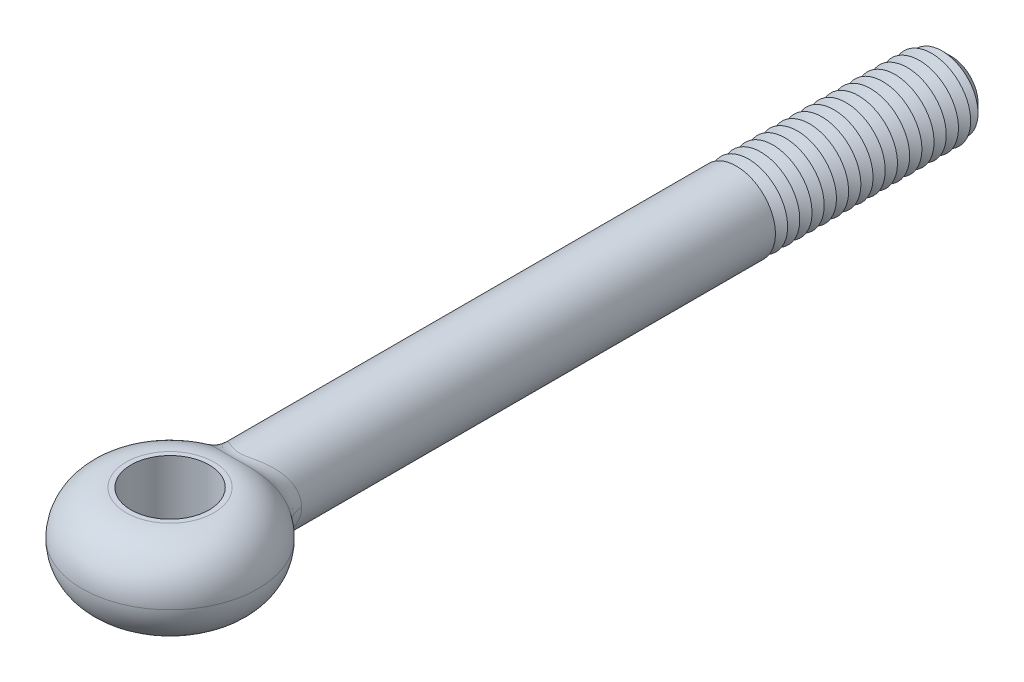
ISO-10303-21;
HEADER;
FILE_DESCRIPTION(('STEP AP214'),'2;1');
FILE_NAME('part.step','',(''),(''),'','','');
FILE_SCHEMA(('AUTOMOTIVE_DESIGN { 1 0 10303 214 1 1 1 1 }'));
ENDSEC;
DATA;
#1=APPLICATION_CONTEXT('core data for automotive mechanical design processes');
#2=APPLICATION_PROTOCOL_DEFINITION('international standard','automotive_design',2000,#1);
#3=PRODUCT_CONTEXT('',#1,'mechanical');
#4=PRODUCT('Part','Part','',(#3));
#5=PRODUCT_RELATED_PRODUCT_CATEGORY('part','',(#4));
#6=PRODUCT_DEFINITION_FORMATION('','',#4);
#7=PRODUCT_DEFINITION_CONTEXT('part definition',#1,'design');
#8=PRODUCT_DEFINITION('design','',#6,#7);
#9=PRODUCT_DEFINITION_SHAPE('','',#8);
#10=(LENGTH_UNIT() NAMED_UNIT(*) SI_UNIT(.MILLI.,.METRE.));
#11=(NAMED_UNIT(*) PLANE_ANGLE_UNIT() SI_UNIT($,.RADIAN.));
#12=(NAMED_UNIT(*) SI_UNIT($,.STERADIAN.) SOLID_ANGLE_UNIT());
#13=UNCERTAINTY_MEASURE_WITH_UNIT(LENGTH_MEASURE(1.E-05),#10,'distance_accuracy_value','');
#14=(GEOMETRIC_REPRESENTATION_CONTEXT(3) GLOBAL_UNCERTAINTY_ASSIGNED_CONTEXT((#13)) GLOBAL_UNIT_ASSIGNED_CONTEXT((#10,
#11,#12)) REPRESENTATION_CONTEXT('',''));
#15=CARTESIAN_POINT('',(0.,0.,0.));
#16=DIRECTION('',(0.,0.,1.));
#17=DIRECTION('',(1.,0.,0.));
#18=AXIS2_PLACEMENT_3D('',#15,#16,#17);
#19=CARTESIAN_POINT('',(0.,0.,-80.));
#20=DIRECTION('',(0.,0.,1.));
#21=DIRECTION('',(1.,0.,0.));
#22=AXIS2_PLACEMENT_3D('',#19,#20,#21);
#23=CYLINDRICAL_SURFACE('',#22,4.);
#24=CARTESIAN_POINT('',(0.,0.,-58.));
#25=DIRECTION('',(0.,0.,-1.));
#26=DIRECTION('',(-1.,0.,0.));
#27=AXIS2_PLACEMENT_3D('',#24,#25,#26);
#28=CIRCLE('',#27,4.);
#29=CARTESIAN_POINT('',(-4.,0.,-58.));
#30=VERTEX_POINT('',#29);
#31=EDGE_CURVE('E80',#30,#30,#28,.T.);
#32=ORIENTED_EDGE('',*,*,#31,.F.);
#33=EDGE_LOOP('',(#32));
#34=FACE_BOUND('',#33,.T.);
#35=CARTESIAN_POINT('',(4.20962840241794,-2.43928241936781,-7.13180336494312));
#36=CARTESIAN_POINT('',(3.41508318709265,-2.1022410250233,-7.85325099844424));
#37=CARTESIAN_POINT('',(3.24770536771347,-2.33503958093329,-8.94098956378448));
#38=CARTESIAN_POINT('',(4.28087481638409,-2.35167865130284,-7.15538303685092));
#39=CARTESIAN_POINT('',(3.46594050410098,-2.01878134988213,-7.88016438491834));
#40=CARTESIAN_POINT('',(3.3080123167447,-2.25117956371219,-8.98524624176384));
#41=CARTESIAN_POINT('',(4.34829202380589,-2.26129214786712,-7.17775809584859));
#42=CARTESIAN_POINT('',(3.51321978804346,-1.934229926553,-7.90531474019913));
#43=CARTESIAN_POINT('',(3.36528002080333,-2.16465573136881,-9.02717355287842));
#44=CARTESIAN_POINT('',(4.47506957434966,-2.07545821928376,-7.21991515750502));
#45=CARTESIAN_POINT('',(3.60104623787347,-1.76294616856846,-7.95222957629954));
#46=CARTESIAN_POINT('',(3.47326653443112,-1.98676342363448,-9.10606640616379));
#47=CARTESIAN_POINT('',(4.53442750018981,-1.98000928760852,-7.23969638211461));
#48=CARTESIAN_POINT('',(3.64154402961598,-1.67624067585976,-7.97396863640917));
#49=CARTESIAN_POINT('',(3.52398337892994,-1.89539350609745,-9.14303045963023));
#50=CARTESIAN_POINT('',(4.64467184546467,-1.78456033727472,-7.27647659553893));
#51=CARTESIAN_POINT('',(3.71589642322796,-1.50113175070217,-8.014023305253));
#52=CARTESIAN_POINT('',(3.61838416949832,-1.70829707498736,-9.21168368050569));
#53=CARTESIAN_POINT('',(4.69555410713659,-1.68455811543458,-7.293474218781));
#54=CARTESIAN_POINT('',(3.74970371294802,-1.41276539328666,-8.0323140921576));
#55=CARTESIAN_POINT('',(3.66206466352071,-1.6125684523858,-9.24337025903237));
#56=CARTESIAN_POINT('',(4.78841066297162,-1.4807377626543,-7.3245150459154));
#57=CARTESIAN_POINT('',(3.81076645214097,-1.23482800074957,-8.06545380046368));
#58=CARTESIAN_POINT('',(3.74191652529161,-1.41745837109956,-9.30118312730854));
#59=CARTESIAN_POINT('',(4.83038616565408,-1.37692015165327,-7.3385586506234));
#60=CARTESIAN_POINT('',(3.8379839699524,-1.1453037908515,-8.0802824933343));
#61=CARTESIAN_POINT('',(3.77808891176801,-1.31807741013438,-9.3273101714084));
#62=CARTESIAN_POINT('',(4.93998011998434,-1.06760765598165,-7.37523749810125));
#63=CARTESIAN_POINT('',(3.90855592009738,-0.880980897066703,-8.11882669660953));
#64=CARTESIAN_POINT('',(3.87264914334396,-1.02198339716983,-9.39550169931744));
#65=CARTESIAN_POINT('',(4.99497846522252,-0.857630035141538,-7.39366200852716));
#66=CARTESIAN_POINT('',(3.94292721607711,-0.705496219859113,-8.13773727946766));
#67=CARTESIAN_POINT('',(3.92027139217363,-0.8209791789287,-9.42968891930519));
#68=CARTESIAN_POINT('',(5.06845478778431,-0.431772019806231,-7.41827830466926));
#69=CARTESIAN_POINT('',(3.98870275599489,-0.353118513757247,-8.16296207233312));
#70=CARTESIAN_POINT('',(3.98393665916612,-0.413320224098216,-9.47534719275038));
#71=CARTESIAN_POINT('',(5.08696110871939,-0.215896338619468,-7.42447958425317));
#72=CARTESIAN_POINT('',(4.00000180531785,-0.176691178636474,-8.16921842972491));
#73=CARTESIAN_POINT('',(4.00000418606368,-0.206669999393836,-9.48683587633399));
#74=CARTESIAN_POINT('',(5.08695185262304,0.2197622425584,-7.42447635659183));
#75=CARTESIAN_POINT('',(3.99999816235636,0.179854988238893,-8.16921612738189));
#76=CARTESIAN_POINT('',(3.99999573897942,0.210370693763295,-9.48683003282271));
#77=CARTESIAN_POINT('',(5.06776741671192,0.439545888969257,-7.41804771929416));
#78=CARTESIAN_POINT('',(3.98828744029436,0.359474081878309,-8.16273153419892));
#79=CARTESIAN_POINT('',(3.98333904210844,0.420761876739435,-9.47492027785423));
#80=CARTESIAN_POINT('',(4.99168987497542,0.872694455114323,-7.39256061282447));
#81=CARTESIAN_POINT('',(3.94086979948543,0.718015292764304,-8.13660527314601));
#82=CARTESIAN_POINT('',(3.91742407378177,0.835399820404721,-9.42764524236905));
#83=CARTESIAN_POINT('',(4.93478135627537,1.08605671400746,-7.37349698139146));
#84=CARTESIAN_POINT('',(3.90528498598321,0.896448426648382,-8.11703072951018));
#85=CARTESIAN_POINT('',(3.86815247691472,1.03964403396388,-9.39227037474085));
#86=CARTESIAN_POINT('',(4.78531683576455,1.49992996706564,-7.32347555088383));
#87=CARTESIAN_POINT('',(3.80902553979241,1.25022198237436,-8.06447660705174));
#88=CARTESIAN_POINT('',(3.73921411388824,1.43583039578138,-9.29926343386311));
#89=CARTESIAN_POINT('',(4.69282180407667,1.70046226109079,-7.29253809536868));
#90=CARTESIAN_POINT('',(3.74864333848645,1.42515573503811,-8.03165463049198));
#91=CARTESIAN_POINT('',(3.65959933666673,1.62779293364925,-9.24166942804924));
#92=CARTESIAN_POINT('',(4.47502076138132,2.08399669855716,-7.2198795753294));
#93=CARTESIAN_POINT('',(3.60161000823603,1.76909189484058,-7.95246604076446));
#94=CARTESIAN_POINT('',(3.47312999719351,1.99493701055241,-9.10603484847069));
#95=CARTESIAN_POINT('',(4.34971613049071,2.26699957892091,-7.17815896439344));
#96=CARTESIAN_POINT('',(3.51529520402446,1.93780912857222,-7.90627607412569));
#97=CARTESIAN_POINT('',(3.36627658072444,2.17011925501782,-9.02799513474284));
#98=CARTESIAN_POINT('',(4.06503409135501,2.61710755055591,-7.08395651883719));
#99=CARTESIAN_POINT('',(3.31258804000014,2.2704191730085,-7.7990178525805));
#100=CARTESIAN_POINT('',(3.12531975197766,2.50526534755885,-8.85118504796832));
#101=CARTESIAN_POINT('',(3.90469024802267,2.78351182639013,-7.03117167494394));
#102=CARTESIAN_POINT('',(3.19569010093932,2.43389360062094,-7.73770595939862));
#103=CARTESIAN_POINT('',(2.99045029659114,2.66455832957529,-8.75182853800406));
#104=CARTESIAN_POINT('',(3.55572279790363,3.09056742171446,-6.91783262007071));
#105=CARTESIAN_POINT('',(2.93333047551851,2.74510282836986,-7.60227773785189));
#106=CARTESIAN_POINT('',(2.70000717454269,2.95849189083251,-8.5376096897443));
#107=CARTESIAN_POINT('',(3.36708914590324,3.23120955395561,-6.85727565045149));
#108=CARTESIAN_POINT('',(2.78824007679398,2.89288136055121,-7.52833413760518));
#109=CARTESIAN_POINT('',(2.54442615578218,3.09312367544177,-8.42274184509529));
#110=CARTESIAN_POINT('',(3.05590482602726,3.42698066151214,-6.7601891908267));
#111=CARTESIAN_POINT('',(2.54246419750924,3.10521527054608,-7.40650692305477));
#112=CARTESIAN_POINT('',(2.29139242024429,3.28052849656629,-8.23777021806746));
#113=CARTESIAN_POINT('',(2.94239191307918,3.49188009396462,-6.72527979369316));
#114=CARTESIAN_POINT('',(2.45203508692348,3.17679613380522,-7.3622733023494));
#115=CARTESIAN_POINT('',(2.19974288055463,3.34265444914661,-8.1711096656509));
#116=CARTESIAN_POINT('',(2.70774871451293,3.61334721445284,-6.65476356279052));
#117=CARTESIAN_POINT('',(2.2631888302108,3.31294369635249,-7.27185687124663));
#118=CARTESIAN_POINT('',(2.01195985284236,3.45893066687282,-8.03614064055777));
#119=CARTESIAN_POINT('',(2.58662025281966,3.66991688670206,-6.61915689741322));
#120=CARTESIAN_POINT('',(2.16480399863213,3.37756025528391,-7.22567879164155));
#121=CARTESIAN_POINT('',(1.91582743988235,3.51308283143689,-7.96783256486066));
#122=CARTESIAN_POINT('',(2.33643912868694,3.7746567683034,-6.5481070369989));
#123=CARTESIAN_POINT('',(1.95995542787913,3.49905860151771,-7.13254784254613));
#124=CARTESIAN_POINT('',(1.71927955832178,3.61334665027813,-7.83121951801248));
#125=CARTESIAN_POINT('',(2.20737584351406,3.82281537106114,-6.51266413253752));
#126=CARTESIAN_POINT('',(1.85349180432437,3.55598889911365,-7.08558378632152));
#127=CARTESIAN_POINT('',(1.61885840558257,3.65944719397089,-7.76291467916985));
#128=CARTESIAN_POINT('',(1.94104355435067,3.91049331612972,-6.44329335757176));
#129=CARTESIAN_POINT('',(1.6325295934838,3.66114192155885,-6.99281685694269));
#130=CARTESIAN_POINT('',(1.41399106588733,3.74337821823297,-7.62894442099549));
#131=CARTESIAN_POINT('',(1.80377767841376,3.9500159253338,-6.40936491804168));
#132=CARTESIAN_POINT('',(1.51802234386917,3.70943392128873,-6.94698677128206));
#133=CARTESIAN_POINT('',(1.3095464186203,3.78121182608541,-7.56327801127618));
#134=CARTESIAN_POINT('',(1.57227788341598,4.0073375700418,-6.35676863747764));
#135=CARTESIAN_POINT('',(1.32409359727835,3.78043323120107,-6.87537018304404));
#136=CARTESIAN_POINT('',(1.13554714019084,3.83608382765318,-7.46130151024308));
#137=CARTESIAN_POINT('',(1.48068953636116,4.02779217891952,-6.33706161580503));
#138=CARTESIAN_POINT('',(1.24725687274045,3.80602263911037,-6.84840856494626));
#139=CARTESIAN_POINT('',(1.0672193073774,3.85566430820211,-7.42304591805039));
#140=CARTESIAN_POINT('',(1.29376653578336,4.06503946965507,-6.29972707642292));
#141=CARTESIAN_POINT('',(1.09023122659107,3.85298164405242,-6.79713154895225));
#142=CARTESIAN_POINT('',(0.928835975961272,3.89131983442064,-7.35050186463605));
#143=CARTESIAN_POINT('',(1.19843101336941,4.08183129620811,-6.28210004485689));
#144=CARTESIAN_POINT('',(1.01002281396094,3.87436823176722,-6.77280179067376));
#145=CARTESIAN_POINT('',(0.858780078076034,3.90739406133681,-7.31621433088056));
#146=CARTESIAN_POINT('',(1.00443416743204,4.11153418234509,-6.24984169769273));
#147=CARTESIAN_POINT('',(0.846704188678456,3.91244466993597,-6.72814466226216));
#148=CARTESIAN_POINT('',(0.717251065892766,3.93582759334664,-7.25341859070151));
#149=CARTESIAN_POINT('',(0.905787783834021,4.12446059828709,-6.23519860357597));
#150=CARTESIAN_POINT('',(0.763580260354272,3.92916988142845,-6.70778483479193));
#151=CARTESIAN_POINT('',(0.645784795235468,3.94820159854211,-7.22488766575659));
#152=CARTESIAN_POINT('',(0.705195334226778,4.14632005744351,-6.20979408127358));
#153=CARTESIAN_POINT('',(0.594535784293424,3.95758629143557,-6.67239577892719));
#154=CARTESIAN_POINT('',(0.5013462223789,3.96912689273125,-7.17536275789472));
#155=CARTESIAN_POINT('',(0.603251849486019,4.15525614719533,-6.19902969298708));
#156=CARTESIAN_POINT('',(0.508579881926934,3.96929598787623,-6.65734565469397));
#157=CARTESIAN_POINT('',(0.428375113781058,3.97768109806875,-7.1543630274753));
#158=CARTESIAN_POINT('',(0.412029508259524,4.16793662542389,-6.18352731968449));
#159=CARTESIAN_POINT('',(0.347370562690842,3.98595413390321,-6.63565356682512));
#160=CARTESIAN_POINT('',(0.292075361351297,3.98981967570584,-7.12411158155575));
#161=CARTESIAN_POINT('',(0.32308798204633,4.17225051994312,-6.17813670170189));
#162=CARTESIAN_POINT('',(0.272375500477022,3.99164885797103,-6.62809397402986));
#163=CARTESIAN_POINT('',(0.228903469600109,3.99394921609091,-7.11358793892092));
#164=CARTESIAN_POINT('',(0.144284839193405,4.17773453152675,-6.17125850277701));
#165=CARTESIAN_POINT('',(0.121644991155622,3.99889046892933,-6.61844960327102));
#166=CARTESIAN_POINT('',(0.102130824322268,3.99919886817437,-7.10015930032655));
#167=CARTESIAN_POINT('',(0.0544233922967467,4.17890521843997,-6.16977021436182));
#168=CARTESIAN_POINT('',(0.0458757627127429,4.00044140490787,-6.61635946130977));
#169=CARTESIAN_POINT('',(0.0385301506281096,4.00031952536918,-7.09725292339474));
#170=CARTESIAN_POINT('',(-0.125189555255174,4.17807377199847,-6.17082052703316));
#171=CARTESIAN_POINT('',(-0.105535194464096,3.9993418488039,-6.61783304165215));
#172=CARTESIAN_POINT('',(-0.0886280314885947,3.99952361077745,-7.09930377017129));
#173=CARTESIAN_POINT('',(-0.214940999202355,4.17607039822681,-6.17336070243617));
#174=CARTESIAN_POINT('',(-0.181212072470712,3.99668920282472,-6.62139966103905));
#175=CARTESIAN_POINT('',(-0.152185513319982,3.9976058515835,-7.1042640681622));
#176=CARTESIAN_POINT('',(-0.393267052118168,4.16893881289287,-6.18226051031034));
#177=CARTESIAN_POINT('',(-0.331541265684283,3.98728173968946,-6.633873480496));
#178=CARTESIAN_POINT('',(-0.278751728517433,3.99077903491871,-7.12163796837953));
#179=CARTESIAN_POINT('',(-0.481841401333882,4.16380992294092,-6.18862097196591));
#180=CARTESIAN_POINT('',(-0.406226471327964,3.98052180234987,-6.64278739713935));
#181=CARTESIAN_POINT('',(-0.341760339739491,3.98586932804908,-7.13405318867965));
#182=CARTESIAN_POINT('',(-0.688095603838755,4.14817563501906,-6.20755254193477));
#183=CARTESIAN_POINT('',(-0.580119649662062,3.96002144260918,-6.66925886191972));
#184=CARTESIAN_POINT('',(-0.48906356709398,3.97090317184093,-7.17098958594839));
#185=CARTESIAN_POINT('',(-0.804946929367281,4.13640802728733,-6.22152677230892));
#186=CARTESIAN_POINT('',(-0.678644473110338,3.9446436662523,-6.68877522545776));
#187=CARTESIAN_POINT('',(-0.57297516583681,3.95963845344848,-7.19824359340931));
#188=CARTESIAN_POINT('',(-1.03394062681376,4.1076481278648,-6.25415363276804));
#189=CARTESIAN_POINT('',(-0.871568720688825,3.90744263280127,-6.73412611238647));
#190=CARTESIAN_POINT('',(-0.73864371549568,3.93210760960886,-7.26181631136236));
#191=CARTESIAN_POINT('',(-1.14608021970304,4.09065280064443,-6.27280897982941));
#192=CARTESIAN_POINT('',(-0.966017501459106,3.88559131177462,-6.75999090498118));
#193=CARTESIAN_POINT('',(-0.820399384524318,3.9158385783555,-7.29814028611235));
#194=CARTESIAN_POINT('',(-1.36592763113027,4.05161532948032,-6.31347216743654));
#195=CARTESIAN_POINT('',(-1.15091612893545,3.83597962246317,-6.81605607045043));
#196=CARTESIAN_POINT('',(-0.982033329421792,3.87846937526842,-7.37722308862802));
#197=CARTESIAN_POINT('',(-1.47361079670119,4.02954864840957,-6.33549612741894));
#198=CARTESIAN_POINT('',(-1.24137763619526,3.80816351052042,-6.84630178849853));
#199=CARTESIAN_POINT('',(-1.06190032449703,3.85734571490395,-7.42001284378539));
#200=CARTESIAN_POINT('',(-1.68409994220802,3.98060721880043,-6.38167314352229));
#201=CARTESIAN_POINT('',(-1.41779320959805,3.74723624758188,-6.90932190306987));
#202=CARTESIAN_POINT('',(-1.21937267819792,3.81049579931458,-7.50960647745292));
#203=CARTESIAN_POINT('',(-1.7869061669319,3.95373271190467,-6.40582609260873));
#204=CARTESIAN_POINT('',(-1.50376847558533,3.71409743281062,-6.94211616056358));
#205=CARTESIAN_POINT('',(-1.29697815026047,3.78476977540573,-7.55641015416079));
#206=CARTESIAN_POINT('',(-2.03557249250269,3.88144037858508,-6.46712101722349));
#207=CARTESIAN_POINT('',(-1.71119137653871,3.62603584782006,-7.02483194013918));
#208=CARTESIAN_POINT('',(-1.48626510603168,3.71556685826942,-7.67500708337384));
#209=CARTESIAN_POINT('',(-2.17875790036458,3.8332690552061,-6.50499609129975));
#210=CARTESIAN_POINT('',(-1.82993325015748,3.568260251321,-7.07544885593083));
#211=CARTESIAN_POINT('',(-1.59667404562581,3.66945413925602,-7.74813538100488));
#212=CARTESIAN_POINT('',(-2.45590601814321,3.72693983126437,-6.58149722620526));
#213=CARTESIAN_POINT('',(-2.05811594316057,3.44332588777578,-7.17652007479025));
#214=CARTESIAN_POINT('',(-1.81273207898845,3.56766889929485,-7.8954804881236));
#215=CARTESIAN_POINT('',(-2.58986577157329,3.66877875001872,-6.62012352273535));
#216=CARTESIAN_POINT('',(-2.16754889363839,3.37608608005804,-7.22699422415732));
#217=CARTESIAN_POINT('',(-1.9183796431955,3.51199333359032,-7.96969763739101));
#218=CARTESIAN_POINT('',(-2.84860171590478,3.5427552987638,-6.69676099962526));
#219=CARTESIAN_POINT('',(-2.37693766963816,3.23337235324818,-7.32592299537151));
#220=CARTESIAN_POINT('',(-2.12436385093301,3.39135549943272,-8.11658331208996));
#221=CARTESIAN_POINT('',(-2.97339489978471,3.47491160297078,-6.73477321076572));
#222=CARTESIAN_POINT('',(-2.4768805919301,3.15784823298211,-7.37438139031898));
#223=CARTESIAN_POINT('',(-2.22471021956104,3.32641110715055,-8.18925451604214));
#224=CARTESIAN_POINT('',(-3.21406230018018,3.32961759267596,-6.80935300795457));
#225=CARTESIAN_POINT('',(-2.6674564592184,2.99941031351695,-7.4682507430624));
#226=CARTESIAN_POINT('',(-2.41977314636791,3.18732624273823,-8.33148796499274));
#227=CARTESIAN_POINT('',(-3.32993337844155,3.2521639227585,-6.84592008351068));
#228=CARTESIAN_POINT('',(-2.75803338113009,2.91644504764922,-7.51364407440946));
#229=CARTESIAN_POINT('',(-2.5144877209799,3.11318255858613,-8.40104911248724));
#230=CARTESIAN_POINT('',(-3.55210969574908,3.08816037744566,-6.91681788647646));
#231=CARTESIAN_POINT('',(-2.92947959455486,2.74434343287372,-7.60050775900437));
#232=CARTESIAN_POINT('',(-2.69730128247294,2.95618771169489,-8.53560605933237));
#233=CARTESIAN_POINT('',(-3.65843710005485,3.00163264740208,-6.95115374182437));
#234=CARTESIAN_POINT('',(-3.01030527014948,2.65519145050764,-7.64195973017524));
#235=CARTESIAN_POINT('',(-2.78541551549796,2.87335774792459,-8.6006123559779));
#236=CARTESIAN_POINT('',(-3.86134707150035,2.81971508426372,-7.01714488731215));
#237=CARTESIAN_POINT('',(-3.16239702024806,2.47150088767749,-7.72058753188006));
#238=CARTESIAN_POINT('',(-2.95448336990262,2.69921443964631,-8.725285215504));
#239=CARTESIAN_POINT('',(-3.95792606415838,2.72432202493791,-7.04879919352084));
#240=CARTESIAN_POINT('',(-3.23358189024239,2.37695238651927,-7.75772562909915));
#241=CARTESIAN_POINT('',(-3.03543436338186,2.6078980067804,-8.78494981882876));
#242=CARTESIAN_POINT('',(-4.14062182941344,2.52529349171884,-7.10894613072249));
#243=CARTESIAN_POINT('',(-3.36627848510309,2.18351039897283,-7.82739060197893));
#244=CARTESIAN_POINT('',(-3.18924486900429,2.41737496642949,-8.89810456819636));
#245=CARTESIAN_POINT('',(-4.22674123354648,2.42166010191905,-7.13743955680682));
#246=CARTESIAN_POINT('',(-3.42771044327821,2.08463231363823,-7.85987815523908));
#247=CARTESIAN_POINT('',(-3.26210641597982,2.31817035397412,-8.95159626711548));
#248=CARTESIAN_POINT('',(-4.38787338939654,2.20680171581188,-7.19089612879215));
#249=CARTESIAN_POINT('',(-3.54098239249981,1.88340090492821,-7.92009157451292));
#250=CARTESIAN_POINT('',(-3.39891556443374,2.11249395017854,-9.05178694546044));
#251=CARTESIAN_POINT('',(-4.46288140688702,2.09557351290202,-7.21585776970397));
#252=CARTESIAN_POINT('',(-3.59273623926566,1.78108328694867,-7.94777357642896));
#253=CARTESIAN_POINT('',(-3.46285936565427,2.00601908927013,-9.0984830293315));
#254=CARTESIAN_POINT('',(-4.59457320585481,1.87716338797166,-7.25975188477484));
#255=CARTESIAN_POINT('',(-3.68233447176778,1.58359654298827,-7.99590902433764));
#256=CARTESIAN_POINT('',(-3.57543701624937,1.7969427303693,-9.18048322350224));
#257=CARTESIAN_POINT('',(-4.65231387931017,1.77057286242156,-7.27902964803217));
#258=CARTESIAN_POINT('',(-3.72098386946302,1.4886580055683,-8.01677413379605));
#259=CARTESIAN_POINT('',(-3.62494279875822,1.69490735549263,-9.21644383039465));
#260=CARTESIAN_POINT('',(-4.75753290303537,1.55269637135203,-7.31418809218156));
#261=CARTESIAN_POINT('',(-3.79061799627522,1.29722505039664,-8.05449646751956));
#262=CARTESIAN_POINT('',(-3.71533333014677,1.48634182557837,-9.28196073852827));
#263=CARTESIAN_POINT('',(-4.80501232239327,1.4414108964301,-7.33006912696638));
#264=CARTESIAN_POINT('',(-3.82155281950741,1.20078670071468,-8.07132717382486));
#265=CARTESIAN_POINT('',(-3.75621897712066,1.37981214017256,-9.31151770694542));
#266=CARTESIAN_POINT('',(-4.88918515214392,1.21522310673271,-7.35823582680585));
#267=CARTESIAN_POINT('',(-3.87588351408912,1.00699635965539,-8.10097036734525));
#268=CARTESIAN_POINT('',(-3.82880765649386,1.16329049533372,-9.36389868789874));
#269=CARTESIAN_POINT('',(-4.92589907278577,1.10032813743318,-7.3705283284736));
#270=CARTESIAN_POINT('',(-3.89925185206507,0.909712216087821,-8.11376793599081));
#271=CARTESIAN_POINT('',(-3.86052814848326,1.05330556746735,-9.38673550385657));
#272=CARTESIAN_POINT('',(-4.98828435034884,0.867715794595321,-7.39142041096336));
#273=CARTESIAN_POINT('',(-3.93869332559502,0.714454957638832,-8.13541291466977));
#274=CARTESIAN_POINT('',(-3.91448130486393,0.830633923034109,-9.42552718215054));
#275=CARTESIAN_POINT('',(-5.01396103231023,0.749999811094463,-7.4000217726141));
#276=CARTESIAN_POINT('',(-3.95473808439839,0.616556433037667,-8.14424484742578));
#277=CARTESIAN_POINT('',(-3.93671854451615,0.717948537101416,-9.4414853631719));
#278=CARTESIAN_POINT('',(-5.05160356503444,0.527069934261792,-7.41263256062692));
#279=CARTESIAN_POINT('',(-3.97817394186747,0.432202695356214,-8.15716098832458));
#280=CARTESIAN_POINT('',(-3.96933623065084,0.504545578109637,-9.46487511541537));
#281=CARTESIAN_POINT('',(-5.06485252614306,0.422066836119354,-7.41707168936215));
#282=CARTESIAN_POINT('',(-3.98636384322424,0.345839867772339,-8.16168301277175));
#283=CARTESIAN_POINT('',(-3.98082580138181,0.404029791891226,-9.47310478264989));
#284=CARTESIAN_POINT('',(-5.08253053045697,0.211392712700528,-7.42299491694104));
#285=CARTESIAN_POINT('',(-3.99727804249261,0.172971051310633,-8.16771217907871));
#286=CARTESIAN_POINT('',(-3.99615939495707,0.202358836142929,-9.48408450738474));
#287=CARTESIAN_POINT('',(-5.0869624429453,0.105721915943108,-7.42447997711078));
#288=CARTESIAN_POINT('',(-3.99999698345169,0.0865213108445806,-8.16921636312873));
#289=CARTESIAN_POINT('',(-4.00000590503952,0.101203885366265,-9.48683634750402));
#290=CARTESIAN_POINT('',(-5.08694423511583,-0.219375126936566,-7.42447385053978));
#291=CARTESIAN_POINT('',(-4.00000625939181,-0.179533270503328,-8.16921920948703));
#292=CARTESIAN_POINT('',(-3.99998774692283,-0.210000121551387,-9.48682599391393));
#293=CARTESIAN_POINT('',(-5.06782392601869,-0.438970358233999,-7.41806690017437));
#294=CARTESIAN_POINT('',(-3.98832493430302,-0.358996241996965,-8.16275208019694));
#295=CARTESIAN_POINT('',(-3.98338811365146,-0.420210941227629,-9.47495588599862));
#296=CARTESIAN_POINT('',(-4.99181098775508,-0.872258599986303,-7.39260093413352));
#297=CARTESIAN_POINT('',(-3.94094286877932,-0.717656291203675,-8.13664564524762));
#298=CARTESIAN_POINT('',(-3.91752889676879,-0.83498259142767,-9.42771999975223));
#299=CARTESIAN_POINT('',(-4.93481503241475,-1.08593379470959,-7.37350730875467));
#300=CARTESIAN_POINT('',(-3.9053086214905,-0.89636142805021,-8.11704297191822));
#301=CARTESIAN_POINT('',(-3.86817997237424,-1.03952636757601,-9.3922899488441));
#302=CARTESIAN_POINT('',(-4.82260503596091,-1.39669226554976,-7.33595529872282));
#303=CARTESIAN_POINT('',(-3.8329428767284,-1.16232084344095,-8.07753492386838));
#304=CARTESIAN_POINT('',(-3.77138225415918,-1.3370045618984,-9.32246736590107));
#305=CARTESIAN_POINT('',(-4.78077456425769,-1.4986077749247,-7.32196123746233));
#306=CARTESIAN_POINT('',(-3.80577950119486,-1.25032878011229,-8.0627417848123));
#307=CARTESIAN_POINT('',(-3.73534257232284,-1.43456470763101,-9.29642949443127));
#308=CARTESIAN_POINT('',(-4.6885140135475,-1.6987113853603,-7.29112215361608));
#309=CARTESIAN_POINT('',(-3.74503190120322,-1.42524573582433,-8.02978510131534));
#310=CARTESIAN_POINT('',(-3.65601915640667,-1.62611688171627,-9.23898630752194));
#311=CARTESIAN_POINT('',(-4.63808284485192,-1.79689901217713,-7.27427676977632));
#312=CARTESIAN_POINT('',(-3.7114841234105,-1.51211059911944,-8.01164097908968));
#313=CARTESIAN_POINT('',(-3.6127345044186,-1.72010845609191,-9.20758031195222));
#314=CARTESIAN_POINT('',(-4.52912947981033,-1.98866953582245,-7.23793066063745));
#315=CARTESIAN_POINT('',(-3.63793253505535,-1.68409419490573,-7.97202907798));
#316=CARTESIAN_POINT('',(-3.51945525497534,-1.90368365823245,-9.13973150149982));
#317=CARTESIAN_POINT('',(-4.47062629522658,-2.08226257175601,-7.21843617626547));
#318=CARTESIAN_POINT('',(-3.59798595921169,-1.76918038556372,-7.95059120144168));
#319=CARTESIAN_POINT('',(-3.46947643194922,-1.99327699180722,-9.10330052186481));
#320=CARTESIAN_POINT('',(-4.34585406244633,-2.2645576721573,-7.17694883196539));
#321=CARTESIAN_POINT('',(-3.51150587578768,-1.93729298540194,-7.90440294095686));
#322=CARTESIAN_POINT('',(-3.36320902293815,-2.16778170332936,-9.02565711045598));
#323=CARTESIAN_POINT('',(-4.27958724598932,-2.3532611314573,-7.15495669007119));
#324=CARTESIAN_POINT('',(-3.46501911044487,-2.02029414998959,-7.87967661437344));
#325=CARTESIAN_POINT('',(-3.30692225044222,-2.2526944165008,-8.98444605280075));
#326=CARTESIAN_POINT('',(-4.20962840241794,-2.43928241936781,-7.13180336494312));
#327=CARTESIAN_POINT('',(-3.41508318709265,-2.1022410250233,-7.85325099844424));
#328=CARTESIAN_POINT('',(-3.24770536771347,-2.33503958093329,-8.94098956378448));
#329=(BOUNDED_SURFACE() B_SPLINE_SURFACE(3,2,((#35,#36,#37),(#38,#39,#40),(#41,#42,#43),(#44,
#45,#46),(#47,#48,#49),(#50,#51,#52),(#53,#54,#55),(#56,#57,#58),(#59,#60,#61),(#62,#63,#64),
(#65,#66,#67),(#68,#69,#70),(#71,#72,#73),(#74,#75,#76),(#77,#78,#79),(#80,#81,#82),(#83,#84,
#85),(#86,#87,#88),(#89,#90,#91),(#92,#93,#94),(#95,#96,#97),(#98,#99,#100),(#101,#102,#103),
(#104,#105,#106),(#107,#108,#109),(#110,#111,#112),(#113,#114,#115),(#116,#117,#118),(#119,#120,
#121),(#122,#123,#124),(#125,#126,#127),(#128,#129,#130),(#131,#132,#133),(#134,#135,#136),
(#137,#138,#139),(#140,#141,#142),(#143,#144,#145),(#146,#147,#148),(#149,#150,#151),(#152,#153,
#154),(#155,#156,#157),(#158,#159,#160),(#161,#162,#163),(#164,#165,#166),(#167,#168,#169),
(#170,#171,#172),(#173,#174,#175),(#176,#177,#178),(#179,#180,#181),(#182,#183,#184),(#185,#186,
#187),(#188,#189,#190),(#191,#192,#193),(#194,#195,#196),(#197,#198,#199),(#200,#201,#202),
(#203,#204,#205),(#206,#207,#208),(#209,#210,#211),(#212,#213,#214),(#215,#216,#217),(#218,#219,
#220),(#221,#222,#223),(#224,#225,#226),(#227,#228,#229),(#230,#231,#232),(#233,#234,#235),
(#236,#237,#238),(#239,#240,#241),(#242,#243,#244),(#245,#246,#247),(#248,#249,#250),(#251,#252,
#253),(#254,#255,#256),(#257,#258,#259),(#260,#261,#262),(#263,#264,#265),(#266,#267,#268),
(#269,#270,#271),(#272,#273,#274),(#275,#276,#277),(#278,#279,#280),(#281,#282,#283),(#284,#285,
#286),(#287,#288,#289),(#290,#291,#292),(#293,#294,#295),(#296,#297,#298),(#299,#300,#301),
(#302,#303,#304),(#305,#306,#307),(#308,#309,#310),(#311,#312,#313),(#314,#315,#316),(#317,#318,
#319),(#320,#321,#322),(#323,#324,#325),(#326,#327,#328)),.UNSPECIFIED.,.F.,.F.,
.F.) B_SPLINE_SURFACE_WITH_KNOTS((4,2,2,2,2,2,2,2,2,2,2,2,2,2,2,2,2,2,2,2,2,2,2,2,2,2,2,2,2,2,2,
2,2,2,2,2,2,2,2,2,2,2,2,2,2,2,2,2,4),(3,3),(0.,0.520645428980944,1.04144667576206,
1.56250265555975,2.08348789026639,3.09060934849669,4.09694825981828,5.12130697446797,
6.14608446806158,7.16911398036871,8.19210046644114,9.2479961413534,10.3042676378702,
10.8793995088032,11.4543941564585,12.0301760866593,12.6057398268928,12.9705703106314,
13.3354858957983,13.6989318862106,14.0620999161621,14.3719634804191,14.6817708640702,
14.9916993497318,15.301695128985,15.7217247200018,16.1419986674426,16.5643505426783,
16.9866811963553,17.6090733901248,18.2316641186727,18.8530699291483,19.4746933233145,
20.0948334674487,20.7152001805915,21.335410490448,21.9558842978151,22.5184424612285,
23.0809419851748,23.6423627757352,24.2035123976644,24.6967605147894,25.1898480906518,
26.2130148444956,27.2389843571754,27.7514948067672,28.2640702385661,28.7754583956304,
29.2866999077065),(0.,1.),
.UNSPECIFIED.) GEOMETRIC_REPRESENTATION_ITEM() RATIONAL_B_SPLINE_SURFACE(((1.,0.911936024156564,
1.),(1.,0.909850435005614,1.),(1.,0.907844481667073,1.),(1.,0.904024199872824,1.),(1.,
0.902209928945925,1.),(1.,0.898805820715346,1.),(1.,0.897216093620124,1.),(1.,0.894291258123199,
1.),(1.,0.892956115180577,1.),(1.,0.889449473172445,1.),(1.,0.887660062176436,1.),(1.,
0.885261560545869,1.),(1.,0.884651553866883,1.),(1.,0.884651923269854,1.),(1.,0.885284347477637,
1.),(1.,0.887767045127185,1.),(1.,0.889617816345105,1.),(1.,0.894396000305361,1.),(1.,
0.897321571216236,1.),(1.,0.904041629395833,1.),(1.,0.907836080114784,1.),(1.,0.91616786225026,
1.),(1.,0.920725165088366,1.),(1.,0.930174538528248,1.),(1.,0.935066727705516,1.),(1.,
0.942600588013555,1.),(1.,0.945252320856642,1.),(1.,0.950486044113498,1.),(1.,0.953068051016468,
1.),(1.,0.958095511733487,1.),(1.,0.960540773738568,1.),(1.,0.965207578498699,1.),(1.,
0.967429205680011,1.),(1.,0.970790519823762,1.),(1.,0.972028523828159,1.),(1.,0.974339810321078,
1.),(1.,0.975413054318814,1.),(1.,0.97735209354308,1.),(1.,0.978218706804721,1.),(1.,
0.979707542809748,1.),(1.,0.980329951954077,1.),(1.,0.981221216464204,1.),(1.,0.981528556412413,
1.),(1.,0.981920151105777,1.),(1.,0.982004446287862,1.),(1.,0.981944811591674,1.),(1.,
0.981800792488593,1.),(1.,0.981293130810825,1.),(1.,0.98092944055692,1.),(1.,0.979837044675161,
1.),(1.,0.979024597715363,1.),(1.,0.977095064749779,1.),(1.,0.975977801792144,1.),(1.,
0.973495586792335,1.),(1.,0.972129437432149,1.),(1.,0.969207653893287,1.),(1.,0.967652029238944,
1.),(1.,0.963624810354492,1.),(1.,0.961068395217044,1.),(1.,0.955756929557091,1.),(1.,
0.95300181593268,1.),(1.,0.947392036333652,1.),(1.,0.94453756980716,1.),(1.,0.938804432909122,
1.),(1.,0.935925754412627,1.),(1.,0.930226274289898,1.),(1.,0.927405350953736,1.),(1.,
0.921882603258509,1.),(1.,0.919180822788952,1.),(1.,0.913963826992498,1.),(1.,0.9114485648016,
1.),(1.,0.906664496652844,1.),(1.,0.904395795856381,1.),(1.,0.900360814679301,1.),(1.,
0.898567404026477,1.),(1.,0.89526897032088,1.),(1.,0.893763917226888,1.),(1.,0.89107726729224,
1.),(1.,0.889895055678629,1.),(1.,0.88787678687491,1.),(1.,0.887040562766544,1.),(1.,
0.885811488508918,1.),(1.,0.88537723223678,1.),(1.,0.884797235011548,1.),(1.,0.884651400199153,
1.),(1.,0.884652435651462,1.),(1.,0.885282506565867,1.),(1.,0.887763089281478,1.),(1.,
0.889616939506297,1.),(1.,0.893203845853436,1.),(1.,0.894533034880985,1.),(1.,0.897436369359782,
1.),(1.,0.899010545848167,1.),(1.,0.902372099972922,1.),(1.,0.904158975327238,1.),(1.,
0.907917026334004,1.),(1.,0.909888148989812,1.),(1.,0.911936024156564,1.))) REPRESENTATION_ITEM('') SURFACE());
#330=CARTESIAN_POINT('',(-3.24770536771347,-2.33503958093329,-8.94098956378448));
#331=CARTESIAN_POINT('',(-3.30692225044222,-2.2526944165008,-8.98444605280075));
#332=CARTESIAN_POINT('',(-3.36320902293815,-2.16778170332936,-9.02565711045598));
#333=CARTESIAN_POINT('',(-3.46947643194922,-1.99327699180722,-9.10330052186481));
#334=CARTESIAN_POINT('',(-3.51945525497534,-1.90368365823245,-9.13973150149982));
#335=CARTESIAN_POINT('',(-3.6127345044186,-1.72010845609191,-9.20758031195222));
#336=CARTESIAN_POINT('',(-3.65601915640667,-1.62611688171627,-9.23898630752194));
#337=CARTESIAN_POINT('',(-3.73534257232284,-1.43456470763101,-9.29642949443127));
#338=CARTESIAN_POINT('',(-3.77138225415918,-1.3370045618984,-9.32246736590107));
#339=CARTESIAN_POINT('',(-3.86817997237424,-1.03952636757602,-9.3922899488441));
#340=CARTESIAN_POINT('',(-3.91752889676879,-0.83498259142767,-9.42771999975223));
#341=CARTESIAN_POINT('',(-3.98338811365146,-0.420210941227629,-9.47495588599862));
#342=CARTESIAN_POINT('',(-3.99998774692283,-0.210000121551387,-9.48682599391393));
#343=CARTESIAN_POINT('',(-4.00000590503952,0.101203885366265,-9.48683634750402));
#344=CARTESIAN_POINT('',(-3.99615939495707,0.202358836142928,-9.48408450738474));
#345=CARTESIAN_POINT('',(-3.98082580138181,0.404029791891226,-9.47310478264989));
#346=CARTESIAN_POINT('',(-3.96933623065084,0.504545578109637,-9.46487511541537));
#347=CARTESIAN_POINT('',(-3.93671854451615,0.717948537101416,-9.4414853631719));
#348=CARTESIAN_POINT('',(-3.91448130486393,0.830633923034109,-9.42552718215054));
#349=CARTESIAN_POINT('',(-3.86052814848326,1.05330556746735,-9.38673550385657));
#350=CARTESIAN_POINT('',(-3.82880765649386,1.16329049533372,-9.36389868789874));
#351=CARTESIAN_POINT('',(-3.75621897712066,1.37981214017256,-9.31151770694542));
#352=CARTESIAN_POINT('',(-3.71533333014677,1.48634182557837,-9.28196073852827));
#353=CARTESIAN_POINT('',(-3.62494279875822,1.69490735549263,-9.21644383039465));
#354=CARTESIAN_POINT('',(-3.57543701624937,1.7969427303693,-9.18048322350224));
#355=CARTESIAN_POINT('',(-3.46285936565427,2.00601908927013,-9.0984830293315));
#356=CARTESIAN_POINT('',(-3.39891556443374,2.11249395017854,-9.05178694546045));
#357=CARTESIAN_POINT('',(-3.26210641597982,2.31817035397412,-8.95159626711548));
#358=CARTESIAN_POINT('',(-3.18924486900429,2.41737496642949,-8.89810456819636));
#359=CARTESIAN_POINT('',(-3.03543436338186,2.6078980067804,-8.78494981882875));
#360=CARTESIAN_POINT('',(-2.95448336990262,2.69921443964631,-8.725285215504));
#361=CARTESIAN_POINT('',(-2.78541551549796,2.87335774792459,-8.6006123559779));
#362=CARTESIAN_POINT('',(-2.69730128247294,2.95618771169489,-8.53560605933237));
#363=CARTESIAN_POINT('',(-2.5144877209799,3.11318255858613,-8.40104911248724));
#364=CARTESIAN_POINT('',(-2.41977314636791,3.18732624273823,-8.33148796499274));
#365=CARTESIAN_POINT('',(-2.22471021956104,3.32641110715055,-8.18925451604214));
#366=CARTESIAN_POINT('',(-2.12436385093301,3.39135549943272,-8.11658331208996));
#367=CARTESIAN_POINT('',(-1.9183796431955,3.51199333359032,-7.96969763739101));
#368=CARTESIAN_POINT('',(-1.81273207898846,3.56766889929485,-7.8954804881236));
#369=CARTESIAN_POINT('',(-1.59667404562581,3.66945413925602,-7.74813538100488));
#370=CARTESIAN_POINT('',(-1.48626510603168,3.71556685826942,-7.67500708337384));
#371=CARTESIAN_POINT('',(-1.29697815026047,3.78476977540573,-7.55641015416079));
#372=CARTESIAN_POINT('',(-1.21937267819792,3.81049579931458,-7.50960647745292));
#373=CARTESIAN_POINT('',(-1.06190032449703,3.85734571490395,-7.42001284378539));
#374=CARTESIAN_POINT('',(-0.982033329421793,3.87846937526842,-7.37722308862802));
#375=CARTESIAN_POINT('',(-0.820399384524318,3.9158385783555,-7.29814028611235));
#376=CARTESIAN_POINT('',(-0.73864371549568,3.93210760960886,-7.26181631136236));
#377=CARTESIAN_POINT('',(-0.572975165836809,3.95963845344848,-7.19824359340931));
#378=CARTESIAN_POINT('',(-0.48906356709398,3.97090317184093,-7.17098958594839));
#379=CARTESIAN_POINT('',(-0.341760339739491,3.98586932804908,-7.13405318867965));
#380=CARTESIAN_POINT('',(-0.278751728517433,3.99077903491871,-7.12163796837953));
#381=CARTESIAN_POINT('',(-0.152185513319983,3.9976058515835,-7.1042640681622));
#382=CARTESIAN_POINT('',(-0.0886280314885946,3.99952361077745,-7.09930377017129));
#383=CARTESIAN_POINT('',(0.0385301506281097,4.00031952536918,-7.09725292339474));
#384=CARTESIAN_POINT('',(0.102130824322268,3.99919886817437,-7.10015930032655));
#385=CARTESIAN_POINT('',(0.228903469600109,3.99394921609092,-7.11358793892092));
#386=CARTESIAN_POINT('',(0.292075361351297,3.98981967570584,-7.12411158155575));
#387=CARTESIAN_POINT('',(0.428375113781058,3.97768109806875,-7.1543630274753));
#388=CARTESIAN_POINT('',(0.5013462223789,3.96912689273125,-7.17536275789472));
#389=CARTESIAN_POINT('',(0.645784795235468,3.94820159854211,-7.22488766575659));
#390=CARTESIAN_POINT('',(0.717251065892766,3.93582759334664,-7.25341859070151));
#391=CARTESIAN_POINT('',(0.858780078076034,3.90739406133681,-7.31621433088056));
#392=CARTESIAN_POINT('',(0.928835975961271,3.89131983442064,-7.35050186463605));
#393=CARTESIAN_POINT('',(1.0672193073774,3.85566430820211,-7.42304591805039));
#394=CARTESIAN_POINT('',(1.13554714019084,3.83608382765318,-7.46130151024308));
#395=CARTESIAN_POINT('',(1.3095464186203,3.78121182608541,-7.56327801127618));
#396=CARTESIAN_POINT('',(1.41399106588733,3.74337821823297,-7.62894442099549));
#397=CARTESIAN_POINT('',(1.61885840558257,3.65944719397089,-7.76291467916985));
#398=CARTESIAN_POINT('',(1.71927955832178,3.61334665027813,-7.83121951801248));
#399=CARTESIAN_POINT('',(1.91582743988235,3.51308283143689,-7.96783256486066));
#400=CARTESIAN_POINT('',(2.01195985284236,3.45893066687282,-8.03614064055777));
#401=CARTESIAN_POINT('',(2.19974288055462,3.34265444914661,-8.1711096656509));
#402=CARTESIAN_POINT('',(2.29139242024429,3.28052849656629,-8.23777021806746));
#403=CARTESIAN_POINT('',(2.54442615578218,3.09312367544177,-8.42274184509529));
#404=CARTESIAN_POINT('',(2.70000717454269,2.95849189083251,-8.5376096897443));
#405=CARTESIAN_POINT('',(2.99045029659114,2.66455832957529,-8.75182853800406));
#406=CARTESIAN_POINT('',(3.12531975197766,2.50526534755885,-8.85118504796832));
#407=CARTESIAN_POINT('',(3.36627658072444,2.17011925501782,-9.02799513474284));
#408=CARTESIAN_POINT('',(3.47312999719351,1.99493701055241,-9.10603484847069));
#409=CARTESIAN_POINT('',(3.65959933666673,1.62779293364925,-9.24166942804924));
#410=CARTESIAN_POINT('',(3.73921411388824,1.43583039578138,-9.29926343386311));
#411=CARTESIAN_POINT('',(3.86815247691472,1.03964403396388,-9.39227037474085));
#412=CARTESIAN_POINT('',(3.91742407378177,0.835399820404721,-9.42764524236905));
#413=CARTESIAN_POINT('',(3.98333904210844,0.420761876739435,-9.47492027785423));
#414=CARTESIAN_POINT('',(3.99999573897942,0.210370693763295,-9.4868300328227));
#415=CARTESIAN_POINT('',(4.00000418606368,-0.206669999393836,-9.48683587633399));
#416=CARTESIAN_POINT('',(3.98393665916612,-0.413320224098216,-9.47534719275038));
#417=CARTESIAN_POINT('',(3.92027139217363,-0.8209791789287,-9.42968891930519));
#418=CARTESIAN_POINT('',(3.87264914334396,-1.02198339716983,-9.39550169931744));
#419=CARTESIAN_POINT('',(3.77808891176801,-1.31807741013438,-9.3273101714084));
#420=CARTESIAN_POINT('',(3.74191652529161,-1.41745837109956,-9.30118312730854));
#421=CARTESIAN_POINT('',(3.66206466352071,-1.6125684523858,-9.24337025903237));
#422=CARTESIAN_POINT('',(3.61838416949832,-1.70829707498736,-9.21168368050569));
#423=CARTESIAN_POINT('',(3.52398337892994,-1.89539350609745,-9.14303045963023));
#424=CARTESIAN_POINT('',(3.47326653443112,-1.98676342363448,-9.10606640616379));
#425=CARTESIAN_POINT('',(3.36528002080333,-2.16465573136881,-9.02717355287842));
#426=CARTESIAN_POINT('',(3.3080123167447,-2.25117956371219,-8.98524624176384));
#427=CARTESIAN_POINT('',(3.24770536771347,-2.33503958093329,-8.94098956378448));
#428=B_SPLINE_CURVE_WITH_KNOTS('',3,(#330,#331,#332,#333,#334,#335,#336,#337,#338,#339,#340,
#341,#342,#343,#344,#345,#346,#347,#348,#349,#350,#351,#352,#353,#354,#355,#356,#357,#358,#359,
#360,#361,#362,#363,#364,#365,#366,#367,#368,#369,#370,#371,#372,#373,#374,#375,#376,#377,#378,
#379,#380,#381,#382,#383,#384,#385,#386,#387,#388,#389,#390,#391,#392,#393,#394,#395,#396,#397,
#398,#399,#400,#401,#402,#403,#404,#405,#406,#407,#408,#409,#410,#411,#412,#413,#414,#415,#416,
#417,#418,#419,#420,#421,#422,#423,#424,#425,#426,#427),.UNSPECIFIED.,.F.,.F.,(4,2,2,2,2,2,2,2,
2,2,2,2,2,2,2,2,2,2,2,2,2,2,2,2,2,2,2,2,2,2,2,2,2,2,2,2,2,2,2,2,2,2,2,2,2,2,2,2,4),(0.,
0.511241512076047,1.02262966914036,1.53520510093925,2.04771555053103,3.07368506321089,
4.09685181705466,4.58993939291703,5.08318751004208,5.64433713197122,6.2057579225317,
6.768257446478,7.33081560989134,7.95128941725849,8.57149972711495,9.19186644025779,
9.81200658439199,10.4336299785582,11.0550357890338,11.6776265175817,12.3000187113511,
12.7223493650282,13.1447012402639,13.5649751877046,13.9850047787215,14.2950005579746,
14.6049290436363,14.9147364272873,15.2245999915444,15.5877680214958,15.9512140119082,
16.3161295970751,16.6809600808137,17.2565238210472,17.8323057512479,18.4073003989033,
18.9824322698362,20.0387037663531,21.0945994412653,22.1175859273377,23.1406154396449,
24.1653929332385,25.1897516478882,26.1960905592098,27.2032120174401,27.7241972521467,
28.2452532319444,28.7660544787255,29.2866999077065),.UNSPECIFIED.);
#429=CARTESIAN_POINT('',(-4.,0.,-9.48683298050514));
#430=VERTEX_POINT('',#429);
#431=CARTESIAN_POINT('',(4.,0.,-9.48683298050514));
#432=VERTEX_POINT('',#431);
#433=EDGE_CURVE('E82',#430,#432,#428,.T.);
#434=ORIENTED_EDGE('',*,*,#433,.T.);
#435=CARTESIAN_POINT('',(-4.20962840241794,2.43928241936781,-7.13180336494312));
#436=CARTESIAN_POINT('',(-3.41508318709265,2.1022410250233,-7.85325099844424));
#437=CARTESIAN_POINT('',(-3.24770536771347,2.33503958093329,-8.94098956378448));
#438=CARTESIAN_POINT('',(-4.28087481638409,2.35167865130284,-7.15538303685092));
#439=CARTESIAN_POINT('',(-3.46594050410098,2.01878134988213,-7.88016438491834));
#440=CARTESIAN_POINT('',(-3.3080123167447,2.25117956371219,-8.98524624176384));
#441=CARTESIAN_POINT('',(-4.34829202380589,2.26129214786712,-7.17775809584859));
#442=CARTESIAN_POINT('',(-3.51321978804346,1.934229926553,-7.90531474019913));
#443=CARTESIAN_POINT('',(-3.36528002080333,2.16465573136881,-9.02717355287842));
#444=CARTESIAN_POINT('',(-4.47506957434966,2.07545821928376,-7.21991515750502));
#445=CARTESIAN_POINT('',(-3.60104623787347,1.76294616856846,-7.95222957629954));
#446=CARTESIAN_POINT('',(-3.47326653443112,1.98676342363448,-9.10606640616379));
#447=CARTESIAN_POINT('',(-4.53442750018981,1.98000928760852,-7.23969638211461));
#448=CARTESIAN_POINT('',(-3.64154402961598,1.67624067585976,-7.97396863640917));
#449=CARTESIAN_POINT('',(-3.52398337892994,1.89539350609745,-9.14303045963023));
#450=CARTESIAN_POINT('',(-4.64467184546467,1.78456033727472,-7.27647659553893));
#451=CARTESIAN_POINT('',(-3.71589642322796,1.50113175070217,-8.014023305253));
#452=CARTESIAN_POINT('',(-3.61838416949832,1.70829707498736,-9.21168368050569));
#453=CARTESIAN_POINT('',(-4.69555410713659,1.68455811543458,-7.293474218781));
#454=CARTESIAN_POINT('',(-3.74970371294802,1.41276539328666,-8.0323140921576));
#455=CARTESIAN_POINT('',(-3.66206466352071,1.6125684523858,-9.24337025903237));
#456=CARTESIAN_POINT('',(-4.78841066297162,1.4807377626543,-7.3245150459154));
#457=CARTESIAN_POINT('',(-3.81076645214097,1.23482800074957,-8.06545380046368));
#458=CARTESIAN_POINT('',(-3.74191652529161,1.41745837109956,-9.30118312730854));
#459=CARTESIAN_POINT('',(-4.83038616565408,1.37692015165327,-7.3385586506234));
#460=CARTESIAN_POINT('',(-3.8379839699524,1.1453037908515,-8.0802824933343));
#461=CARTESIAN_POINT('',(-3.77808891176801,1.31807741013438,-9.3273101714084));
#462=CARTESIAN_POINT('',(-4.93998011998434,1.06760765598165,-7.37523749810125));
#463=CARTESIAN_POINT('',(-3.90855592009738,0.880980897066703,-8.11882669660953));
#464=CARTESIAN_POINT('',(-3.87264914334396,1.02198339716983,-9.39550169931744));
#465=CARTESIAN_POINT('',(-4.99497846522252,0.857630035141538,-7.39366200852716));
#466=CARTESIAN_POINT('',(-3.94292721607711,0.705496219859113,-8.13773727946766));
#467=CARTESIAN_POINT('',(-3.92027139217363,0.8209791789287,-9.42968891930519));
#468=CARTESIAN_POINT('',(-5.06845478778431,0.431772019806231,-7.41827830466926));
#469=CARTESIAN_POINT('',(-3.98870275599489,0.353118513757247,-8.16296207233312));
#470=CARTESIAN_POINT('',(-3.98393665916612,0.413320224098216,-9.47534719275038));
#471=CARTESIAN_POINT('',(-5.08696110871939,0.215896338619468,-7.42447958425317));
#472=CARTESIAN_POINT('',(-4.00000180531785,0.176691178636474,-8.16921842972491));
#473=CARTESIAN_POINT('',(-4.00000418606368,0.206669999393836,-9.48683587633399));
#474=CARTESIAN_POINT('',(-5.08695185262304,-0.2197622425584,-7.42447635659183));
#475=CARTESIAN_POINT('',(-3.99999816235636,-0.179854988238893,-8.16921612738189));
#476=CARTESIAN_POINT('',(-3.99999573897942,-0.210370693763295,-9.48683003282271));
#477=CARTESIAN_POINT('',(-5.06776741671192,-0.439545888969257,-7.41804771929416));
#478=CARTESIAN_POINT('',(-3.98828744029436,-0.359474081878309,-8.16273153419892));
#479=CARTESIAN_POINT('',(-3.98333904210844,-0.420761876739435,-9.47492027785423));
#480=CARTESIAN_POINT('',(-4.99168987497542,-0.872694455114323,-7.39256061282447));
#481=CARTESIAN_POINT('',(-3.94086979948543,-0.718015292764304,-8.13660527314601));
#482=CARTESIAN_POINT('',(-3.91742407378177,-0.835399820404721,-9.42764524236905));
#483=CARTESIAN_POINT('',(-4.93478135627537,-1.08605671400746,-7.37349698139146));
#484=CARTESIAN_POINT('',(-3.90528498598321,-0.896448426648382,-8.11703072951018));
#485=CARTESIAN_POINT('',(-3.86815247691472,-1.03964403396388,-9.39227037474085));
#486=CARTESIAN_POINT('',(-4.78531683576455,-1.49992996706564,-7.32347555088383));
#487=CARTESIAN_POINT('',(-3.80902553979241,-1.25022198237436,-8.06447660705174));
#488=CARTESIAN_POINT('',(-3.73921411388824,-1.43583039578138,-9.29926343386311));
#489=CARTESIAN_POINT('',(-4.69282180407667,-1.70046226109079,-7.29253809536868));
#490=CARTESIAN_POINT('',(-3.74864333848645,-1.42515573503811,-8.03165463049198));
#491=CARTESIAN_POINT('',(-3.65959933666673,-1.62779293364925,-9.24166942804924));
#492=CARTESIAN_POINT('',(-4.47502076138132,-2.08399669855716,-7.2198795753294));
#493=CARTESIAN_POINT('',(-3.60161000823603,-1.76909189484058,-7.95246604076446));
#494=CARTESIAN_POINT('',(-3.47312999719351,-1.99493701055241,-9.10603484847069));
#495=CARTESIAN_POINT('',(-4.34971613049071,-2.26699957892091,-7.17815896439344));
#496=CARTESIAN_POINT('',(-3.51529520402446,-1.93780912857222,-7.90627607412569));
#497=CARTESIAN_POINT('',(-3.36627658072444,-2.17011925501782,-9.02799513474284));
#498=CARTESIAN_POINT('',(-4.06503409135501,-2.61710755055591,-7.08395651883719));
#499=CARTESIAN_POINT('',(-3.31258804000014,-2.2704191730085,-7.7990178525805));
#500=CARTESIAN_POINT('',(-3.12531975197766,-2.50526534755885,-8.85118504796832));
#501=CARTESIAN_POINT('',(-3.90469024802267,-2.78351182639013,-7.03117167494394));
#502=CARTESIAN_POINT('',(-3.19569010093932,-2.43389360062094,-7.73770595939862));
#503=CARTESIAN_POINT('',(-2.99045029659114,-2.66455832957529,-8.75182853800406));
#504=CARTESIAN_POINT('',(-3.55572279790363,-3.09056742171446,-6.91783262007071));
#505=CARTESIAN_POINT('',(-2.93333047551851,-2.74510282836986,-7.60227773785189));
#506=CARTESIAN_POINT('',(-2.70000717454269,-2.95849189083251,-8.5376096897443));
#507=CARTESIAN_POINT('',(-3.36708914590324,-3.23120955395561,-6.85727565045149));
#508=CARTESIAN_POINT('',(-2.78824007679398,-2.89288136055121,-7.52833413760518));
#509=CARTESIAN_POINT('',(-2.54442615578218,-3.09312367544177,-8.42274184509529));
#510=CARTESIAN_POINT('',(-3.05590482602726,-3.42698066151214,-6.7601891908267));
#511=CARTESIAN_POINT('',(-2.54246419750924,-3.10521527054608,-7.40650692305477));
#512=CARTESIAN_POINT('',(-2.29139242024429,-3.28052849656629,-8.23777021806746));
#513=CARTESIAN_POINT('',(-2.94239191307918,-3.49188009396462,-6.72527979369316));
#514=CARTESIAN_POINT('',(-2.45203508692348,-3.17679613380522,-7.3622733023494));
#515=CARTESIAN_POINT('',(-2.19974288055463,-3.34265444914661,-8.1711096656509));
#516=CARTESIAN_POINT('',(-2.70774871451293,-3.61334721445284,-6.65476356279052));
#517=CARTESIAN_POINT('',(-2.2631888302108,-3.31294369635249,-7.27185687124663));
#518=CARTESIAN_POINT('',(-2.01195985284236,-3.45893066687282,-8.03614064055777));
#519=CARTESIAN_POINT('',(-2.58662025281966,-3.66991688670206,-6.61915689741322));
#520=CARTESIAN_POINT('',(-2.16480399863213,-3.37756025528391,-7.22567879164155));
#521=CARTESIAN_POINT('',(-1.91582743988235,-3.51308283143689,-7.96783256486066));
#522=CARTESIAN_POINT('',(-2.33643912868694,-3.7746567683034,-6.5481070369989));
#523=CARTESIAN_POINT('',(-1.95995542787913,-3.49905860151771,-7.13254784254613));
#524=CARTESIAN_POINT('',(-1.71927955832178,-3.61334665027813,-7.83121951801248));
#525=CARTESIAN_POINT('',(-2.20737584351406,-3.82281537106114,-6.51266413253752));
#526=CARTESIAN_POINT('',(-1.85349180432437,-3.55598889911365,-7.08558378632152));
#527=CARTESIAN_POINT('',(-1.61885840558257,-3.65944719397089,-7.76291467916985));
#528=CARTESIAN_POINT('',(-1.94104355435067,-3.91049331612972,-6.44329335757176));
#529=CARTESIAN_POINT('',(-1.6325295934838,-3.66114192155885,-6.99281685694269));
#530=CARTESIAN_POINT('',(-1.41399106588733,-3.74337821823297,-7.62894442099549));
#531=CARTESIAN_POINT('',(-1.80377767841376,-3.9500159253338,-6.40936491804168));
#532=CARTESIAN_POINT('',(-1.51802234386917,-3.70943392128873,-6.94698677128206));
#533=CARTESIAN_POINT('',(-1.3095464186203,-3.78121182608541,-7.56327801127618));
#534=CARTESIAN_POINT('',(-1.57227788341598,-4.0073375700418,-6.35676863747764));
#535=CARTESIAN_POINT('',(-1.32409359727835,-3.78043323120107,-6.87537018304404));
#536=CARTESIAN_POINT('',(-1.13554714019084,-3.83608382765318,-7.46130151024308));
#537=CARTESIAN_POINT('',(-1.48068953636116,-4.02779217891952,-6.33706161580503));
#538=CARTESIAN_POINT('',(-1.24725687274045,-3.80602263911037,-6.84840856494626));
#539=CARTESIAN_POINT('',(-1.0672193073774,-3.85566430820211,-7.42304591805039));
#540=CARTESIAN_POINT('',(-1.29376653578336,-4.06503946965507,-6.29972707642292));
#541=CARTESIAN_POINT('',(-1.09023122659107,-3.85298164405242,-6.79713154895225));
#542=CARTESIAN_POINT('',(-0.928835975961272,-3.89131983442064,-7.35050186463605));
#543=CARTESIAN_POINT('',(-1.19843101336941,-4.08183129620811,-6.28210004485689));
#544=CARTESIAN_POINT('',(-1.01002281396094,-3.87436823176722,-6.77280179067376));
#545=CARTESIAN_POINT('',(-0.858780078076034,-3.90739406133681,-7.31621433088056));
#546=CARTESIAN_POINT('',(-1.00443416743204,-4.11153418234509,-6.24984169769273));
#547=CARTESIAN_POINT('',(-0.846704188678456,-3.91244466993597,-6.72814466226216));
#548=CARTESIAN_POINT('',(-0.717251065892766,-3.93582759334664,-7.25341859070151));
#549=CARTESIAN_POINT('',(-0.905787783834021,-4.12446059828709,-6.23519860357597));
#550=CARTESIAN_POINT('',(-0.763580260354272,-3.92916988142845,-6.70778483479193));
#551=CARTESIAN_POINT('',(-0.645784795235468,-3.94820159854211,-7.22488766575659));
#552=CARTESIAN_POINT('',(-0.705195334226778,-4.14632005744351,-6.20979408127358));
#553=CARTESIAN_POINT('',(-0.594535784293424,-3.95758629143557,-6.67239577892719));
#554=CARTESIAN_POINT('',(-0.5013462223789,-3.96912689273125,-7.17536275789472));
#555=CARTESIAN_POINT('',(-0.603251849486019,-4.15525614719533,-6.19902969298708));
#556=CARTESIAN_POINT('',(-0.508579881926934,-3.96929598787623,-6.65734565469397));
#557=CARTESIAN_POINT('',(-0.428375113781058,-3.97768109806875,-7.1543630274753));
#558=CARTESIAN_POINT('',(-0.412029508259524,-4.16793662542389,-6.18352731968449));
#559=CARTESIAN_POINT('',(-0.347370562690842,-3.98595413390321,-6.63565356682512));
#560=CARTESIAN_POINT('',(-0.292075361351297,-3.98981967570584,-7.12411158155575));
#561=CARTESIAN_POINT('',(-0.32308798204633,-4.17225051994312,-6.17813670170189));
#562=CARTESIAN_POINT('',(-0.272375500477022,-3.99164885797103,-6.62809397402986));
#563=CARTESIAN_POINT('',(-0.228903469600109,-3.99394921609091,-7.11358793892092));
#564=CARTESIAN_POINT('',(-0.144284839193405,-4.17773453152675,-6.17125850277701));
#565=CARTESIAN_POINT('',(-0.121644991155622,-3.99889046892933,-6.61844960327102));
#566=CARTESIAN_POINT('',(-0.102130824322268,-3.99919886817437,-7.10015930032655));
#567=CARTESIAN_POINT('',(-0.0544233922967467,-4.17890521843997,-6.16977021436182));
#568=CARTESIAN_POINT('',(-0.0458757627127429,-4.00044140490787,-6.61635946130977));
#569=CARTESIAN_POINT('',(-0.0385301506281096,-4.00031952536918,-7.09725292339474));
#570=CARTESIAN_POINT('',(0.125189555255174,-4.17807377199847,-6.17082052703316));
#571=CARTESIAN_POINT('',(0.105535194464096,-3.9993418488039,-6.61783304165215));
#572=CARTESIAN_POINT('',(0.0886280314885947,-3.99952361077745,-7.09930377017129));
#573=CARTESIAN_POINT('',(0.214940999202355,-4.17607039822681,-6.17336070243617));
#574=CARTESIAN_POINT('',(0.181212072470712,-3.99668920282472,-6.62139966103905));
#575=CARTESIAN_POINT('',(0.152185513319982,-3.9976058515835,-7.1042640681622));
#576=CARTESIAN_POINT('',(0.393267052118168,-4.16893881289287,-6.18226051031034));
#577=CARTESIAN_POINT('',(0.331541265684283,-3.98728173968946,-6.633873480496));
#578=CARTESIAN_POINT('',(0.278751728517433,-3.99077903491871,-7.12163796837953));
#579=CARTESIAN_POINT('',(0.481841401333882,-4.16380992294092,-6.18862097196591));
#580=CARTESIAN_POINT('',(0.406226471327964,-3.98052180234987,-6.64278739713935));
#581=CARTESIAN_POINT('',(0.341760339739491,-3.98586932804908,-7.13405318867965));
#582=CARTESIAN_POINT('',(0.688095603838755,-4.14817563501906,-6.20755254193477));
#583=CARTESIAN_POINT('',(0.580119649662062,-3.96002144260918,-6.66925886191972));
#584=CARTESIAN_POINT('',(0.48906356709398,-3.97090317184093,-7.17098958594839));
#585=CARTESIAN_POINT('',(0.804946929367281,-4.13640802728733,-6.22152677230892));
#586=CARTESIAN_POINT('',(0.678644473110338,-3.9446436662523,-6.68877522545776));
#587=CARTESIAN_POINT('',(0.57297516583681,-3.95963845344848,-7.19824359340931));
#588=CARTESIAN_POINT('',(1.03394062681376,-4.1076481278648,-6.25415363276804));
#589=CARTESIAN_POINT('',(0.871568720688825,-3.90744263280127,-6.73412611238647));
#590=CARTESIAN_POINT('',(0.73864371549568,-3.93210760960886,-7.26181631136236));
#591=CARTESIAN_POINT('',(1.14608021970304,-4.09065280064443,-6.27280897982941));
#592=CARTESIAN_POINT('',(0.966017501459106,-3.88559131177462,-6.75999090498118));
#593=CARTESIAN_POINT('',(0.820399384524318,-3.9158385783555,-7.29814028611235));
#594=CARTESIAN_POINT('',(1.36592763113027,-4.05161532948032,-6.31347216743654));
#595=CARTESIAN_POINT('',(1.15091612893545,-3.83597962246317,-6.81605607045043));
#596=CARTESIAN_POINT('',(0.982033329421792,-3.87846937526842,-7.37722308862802));
#597=CARTESIAN_POINT('',(1.47361079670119,-4.02954864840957,-6.33549612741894));
#598=CARTESIAN_POINT('',(1.24137763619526,-3.80816351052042,-6.84630178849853));
#599=CARTESIAN_POINT('',(1.06190032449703,-3.85734571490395,-7.42001284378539));
#600=CARTESIAN_POINT('',(1.68409994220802,-3.98060721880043,-6.38167314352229));
#601=CARTESIAN_POINT('',(1.41779320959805,-3.74723624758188,-6.90932190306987));
#602=CARTESIAN_POINT('',(1.21937267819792,-3.81049579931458,-7.50960647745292));
#603=CARTESIAN_POINT('',(1.7869061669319,-3.95373271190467,-6.40582609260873));
#604=CARTESIAN_POINT('',(1.50376847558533,-3.71409743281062,-6.94211616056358));
#605=CARTESIAN_POINT('',(1.29697815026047,-3.78476977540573,-7.55641015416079));
#606=CARTESIAN_POINT('',(2.03557249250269,-3.88144037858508,-6.46712101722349));
#607=CARTESIAN_POINT('',(1.71119137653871,-3.62603584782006,-7.02483194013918));
#608=CARTESIAN_POINT('',(1.48626510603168,-3.71556685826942,-7.67500708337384));
#609=CARTESIAN_POINT('',(2.17875790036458,-3.8332690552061,-6.50499609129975));
#610=CARTESIAN_POINT('',(1.82993325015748,-3.568260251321,-7.07544885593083));
#611=CARTESIAN_POINT('',(1.59667404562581,-3.66945413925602,-7.74813538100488));
#612=CARTESIAN_POINT('',(2.45590601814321,-3.72693983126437,-6.58149722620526));
#613=CARTESIAN_POINT('',(2.05811594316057,-3.44332588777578,-7.17652007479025));
#614=CARTESIAN_POINT('',(1.81273207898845,-3.56766889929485,-7.8954804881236));
#615=CARTESIAN_POINT('',(2.58986577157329,-3.66877875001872,-6.62012352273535));
#616=CARTESIAN_POINT('',(2.16754889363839,-3.37608608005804,-7.22699422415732));
#617=CARTESIAN_POINT('',(1.9183796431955,-3.51199333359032,-7.96969763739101));
#618=CARTESIAN_POINT('',(2.84860171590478,-3.5427552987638,-6.69676099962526));
#619=CARTESIAN_POINT('',(2.37693766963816,-3.23337235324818,-7.32592299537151));
#620=CARTESIAN_POINT('',(2.12436385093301,-3.39135549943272,-8.11658331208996));
#621=CARTESIAN_POINT('',(2.97339489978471,-3.47491160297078,-6.73477321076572));
#622=CARTESIAN_POINT('',(2.4768805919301,-3.15784823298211,-7.37438139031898));
#623=CARTESIAN_POINT('',(2.22471021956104,-3.32641110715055,-8.18925451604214));
#624=CARTESIAN_POINT('',(3.21406230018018,-3.32961759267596,-6.80935300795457));
#625=CARTESIAN_POINT('',(2.6674564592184,-2.99941031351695,-7.4682507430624));
#626=CARTESIAN_POINT('',(2.41977314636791,-3.18732624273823,-8.33148796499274));
#627=CARTESIAN_POINT('',(3.32993337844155,-3.2521639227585,-6.84592008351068));
#628=CARTESIAN_POINT('',(2.75803338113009,-2.91644504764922,-7.51364407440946));
#629=CARTESIAN_POINT('',(2.5144877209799,-3.11318255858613,-8.40104911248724));
#630=CARTESIAN_POINT('',(3.55210969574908,-3.08816037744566,-6.91681788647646));
#631=CARTESIAN_POINT('',(2.92947959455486,-2.74434343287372,-7.60050775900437));
#632=CARTESIAN_POINT('',(2.69730128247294,-2.95618771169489,-8.53560605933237));
#633=CARTESIAN_POINT('',(3.65843710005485,-3.00163264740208,-6.95115374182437));
#634=CARTESIAN_POINT('',(3.01030527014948,-2.65519145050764,-7.64195973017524));
#635=CARTESIAN_POINT('',(2.78541551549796,-2.87335774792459,-8.6006123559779));
#636=CARTESIAN_POINT('',(3.86134707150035,-2.81971508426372,-7.01714488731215));
#637=CARTESIAN_POINT('',(3.16239702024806,-2.47150088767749,-7.72058753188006));
#638=CARTESIAN_POINT('',(2.95448336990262,-2.69921443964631,-8.725285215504));
#639=CARTESIAN_POINT('',(3.95792606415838,-2.72432202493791,-7.04879919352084));
#640=CARTESIAN_POINT('',(3.23358189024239,-2.37695238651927,-7.75772562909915));
#641=CARTESIAN_POINT('',(3.03543436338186,-2.6078980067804,-8.78494981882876));
#642=CARTESIAN_POINT('',(4.14062182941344,-2.52529349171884,-7.10894613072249));
#643=CARTESIAN_POINT('',(3.36627848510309,-2.18351039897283,-7.82739060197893));
#644=CARTESIAN_POINT('',(3.18924486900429,-2.41737496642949,-8.89810456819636));
#645=CARTESIAN_POINT('',(4.22674123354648,-2.42166010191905,-7.13743955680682));
#646=CARTESIAN_POINT('',(3.42771044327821,-2.08463231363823,-7.85987815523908));
#647=CARTESIAN_POINT('',(3.26210641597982,-2.31817035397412,-8.95159626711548));
#648=CARTESIAN_POINT('',(4.38787338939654,-2.20680171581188,-7.19089612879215));
#649=CARTESIAN_POINT('',(3.54098239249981,-1.88340090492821,-7.92009157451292));
#650=CARTESIAN_POINT('',(3.39891556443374,-2.11249395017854,-9.05178694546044));
#651=CARTESIAN_POINT('',(4.46288140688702,-2.09557351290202,-7.21585776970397));
#652=CARTESIAN_POINT('',(3.59273623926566,-1.78108328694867,-7.94777357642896));
#653=CARTESIAN_POINT('',(3.46285936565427,-2.00601908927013,-9.0984830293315));
#654=CARTESIAN_POINT('',(4.59457320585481,-1.87716338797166,-7.25975188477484));
#655=CARTESIAN_POINT('',(3.68233447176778,-1.58359654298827,-7.99590902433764));
#656=CARTESIAN_POINT('',(3.57543701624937,-1.7969427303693,-9.18048322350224));
#657=CARTESIAN_POINT('',(4.65231387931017,-1.77057286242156,-7.27902964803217));
#658=CARTESIAN_POINT('',(3.72098386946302,-1.4886580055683,-8.01677413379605));
#659=CARTESIAN_POINT('',(3.62494279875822,-1.69490735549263,-9.21644383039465));
#660=CARTESIAN_POINT('',(4.75753290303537,-1.55269637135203,-7.31418809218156));
#661=CARTESIAN_POINT('',(3.79061799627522,-1.29722505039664,-8.05449646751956));
#662=CARTESIAN_POINT('',(3.71533333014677,-1.48634182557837,-9.28196073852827));
#663=CARTESIAN_POINT('',(4.80501232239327,-1.4414108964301,-7.33006912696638));
#664=CARTESIAN_POINT('',(3.82155281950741,-1.20078670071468,-8.07132717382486));
#665=CARTESIAN_POINT('',(3.75621897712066,-1.37981214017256,-9.31151770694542));
#666=CARTESIAN_POINT('',(4.88918515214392,-1.21522310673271,-7.35823582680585));
#667=CARTESIAN_POINT('',(3.87588351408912,-1.00699635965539,-8.10097036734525));
#668=CARTESIAN_POINT('',(3.82880765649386,-1.16329049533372,-9.36389868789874));
#669=CARTESIAN_POINT('',(4.92589907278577,-1.10032813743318,-7.3705283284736));
#670=CARTESIAN_POINT('',(3.89925185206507,-0.909712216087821,-8.11376793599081));
#671=CARTESIAN_POINT('',(3.86052814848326,-1.05330556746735,-9.38673550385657));
#672=CARTESIAN_POINT('',(4.98828435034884,-0.867715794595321,-7.39142041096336));
#673=CARTESIAN_POINT('',(3.93869332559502,-0.714454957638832,-8.13541291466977));
#674=CARTESIAN_POINT('',(3.91448130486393,-0.830633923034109,-9.42552718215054));
#675=CARTESIAN_POINT('',(5.01396103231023,-0.749999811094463,-7.4000217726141));
#676=CARTESIAN_POINT('',(3.95473808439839,-0.616556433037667,-8.14424484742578));
#677=CARTESIAN_POINT('',(3.93671854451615,-0.717948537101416,-9.4414853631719));
#678=CARTESIAN_POINT('',(5.05160356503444,-0.527069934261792,-7.41263256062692));
#679=CARTESIAN_POINT('',(3.97817394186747,-0.432202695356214,-8.15716098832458));
#680=CARTESIAN_POINT('',(3.96933623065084,-0.504545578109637,-9.46487511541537));
#681=CARTESIAN_POINT('',(5.06485252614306,-0.422066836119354,-7.41707168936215));
#682=CARTESIAN_POINT('',(3.98636384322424,-0.345839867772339,-8.16168301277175));
#683=CARTESIAN_POINT('',(3.98082580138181,-0.404029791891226,-9.47310478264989));
#684=CARTESIAN_POINT('',(5.08253053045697,-0.211392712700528,-7.42299491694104));
#685=CARTESIAN_POINT('',(3.99727804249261,-0.172971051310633,-8.16771217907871));
#686=CARTESIAN_POINT('',(3.99615939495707,-0.202358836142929,-9.48408450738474));
#687=CARTESIAN_POINT('',(5.0869624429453,-0.105721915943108,-7.42447997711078));
#688=CARTESIAN_POINT('',(3.99999698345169,-0.0865213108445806,-8.16921636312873));
#689=CARTESIAN_POINT('',(4.00000590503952,-0.101203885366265,-9.48683634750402));
#690=CARTESIAN_POINT('',(5.08694423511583,0.219375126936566,-7.42447385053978));
#691=CARTESIAN_POINT('',(4.00000625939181,0.179533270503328,-8.16921920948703));
#692=CARTESIAN_POINT('',(3.99998774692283,0.210000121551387,-9.48682599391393));
#693=CARTESIAN_POINT('',(5.06782392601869,0.438970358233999,-7.41806690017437));
#694=CARTESIAN_POINT('',(3.98832493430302,0.358996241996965,-8.16275208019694));
#695=CARTESIAN_POINT('',(3.98338811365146,0.420210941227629,-9.47495588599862));
#696=CARTESIAN_POINT('',(4.99181098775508,0.872258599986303,-7.39260093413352));
#697=CARTESIAN_POINT('',(3.94094286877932,0.717656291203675,-8.13664564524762));
#698=CARTESIAN_POINT('',(3.91752889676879,0.83498259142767,-9.42771999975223));
#699=CARTESIAN_POINT('',(4.93481503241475,1.08593379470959,-7.37350730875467));
#700=CARTESIAN_POINT('',(3.9053086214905,0.89636142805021,-8.11704297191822));
#701=CARTESIAN_POINT('',(3.86817997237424,1.03952636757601,-9.3922899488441));
#702=CARTESIAN_POINT('',(4.82260503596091,1.39669226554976,-7.33595529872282));
#703=CARTESIAN_POINT('',(3.8329428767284,1.16232084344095,-8.07753492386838));
#704=CARTESIAN_POINT('',(3.77138225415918,1.3370045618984,-9.32246736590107));
#705=CARTESIAN_POINT('',(4.78077456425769,1.4986077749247,-7.32196123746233));
#706=CARTESIAN_POINT('',(3.80577950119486,1.25032878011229,-8.0627417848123));
#707=CARTESIAN_POINT('',(3.73534257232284,1.43456470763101,-9.29642949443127));
#708=CARTESIAN_POINT('',(4.6885140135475,1.6987113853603,-7.29112215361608));
#709=CARTESIAN_POINT('',(3.74503190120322,1.42524573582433,-8.02978510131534));
#710=CARTESIAN_POINT('',(3.65601915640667,1.62611688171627,-9.23898630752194));
#711=CARTESIAN_POINT('',(4.63808284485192,1.79689901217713,-7.27427676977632));
#712=CARTESIAN_POINT('',(3.7114841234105,1.51211059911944,-8.01164097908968));
#713=CARTESIAN_POINT('',(3.6127345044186,1.72010845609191,-9.20758031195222));
#714=CARTESIAN_POINT('',(4.52912947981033,1.98866953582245,-7.23793066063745));
#715=CARTESIAN_POINT('',(3.63793253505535,1.68409419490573,-7.97202907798));
#716=CARTESIAN_POINT('',(3.51945525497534,1.90368365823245,-9.13973150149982));
#717=CARTESIAN_POINT('',(4.47062629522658,2.08226257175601,-7.21843617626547));
#718=CARTESIAN_POINT('',(3.59798595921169,1.76918038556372,-7.95059120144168));
#719=CARTESIAN_POINT('',(3.46947643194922,1.99327699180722,-9.10330052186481));
#720=CARTESIAN_POINT('',(4.34585406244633,2.2645576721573,-7.17694883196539));
#721=CARTESIAN_POINT('',(3.51150587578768,1.93729298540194,-7.90440294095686));
#722=CARTESIAN_POINT('',(3.36320902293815,2.16778170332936,-9.02565711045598));
#723=CARTESIAN_POINT('',(4.27958724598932,2.3532611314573,-7.15495669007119));
#724=CARTESIAN_POINT('',(3.46501911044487,2.02029414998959,-7.87967661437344));
#725=CARTESIAN_POINT('',(3.30692225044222,2.2526944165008,-8.98444605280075));
#726=CARTESIAN_POINT('',(4.20962840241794,2.43928241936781,-7.13180336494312));
#727=CARTESIAN_POINT('',(3.41508318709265,2.1022410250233,-7.85325099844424));
#728=CARTESIAN_POINT('',(3.24770536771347,2.33503958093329,-8.94098956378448));
#729=(BOUNDED_SURFACE() B_SPLINE_SURFACE(3,2,((#435,#436,#437),(#438,#439,#440),(#441,#442,
#443),(#444,#445,#446),(#447,#448,#449),(#450,#451,#452),(#453,#454,#455),(#456,#457,#458),
(#459,#460,#461),(#462,#463,#464),(#465,#466,#467),(#468,#469,#470),(#471,#472,#473),(#474,#475,
#476),(#477,#478,#479),(#480,#481,#482),(#483,#484,#485),(#486,#487,#488),(#489,#490,#491),
(#492,#493,#494),(#495,#496,#497),(#498,#499,#500),(#501,#502,#503),(#504,#505,#506),(#507,#508,
#509),(#510,#511,#512),(#513,#514,#515),(#516,#517,#518),(#519,#520,#521),(#522,#523,#524),
(#525,#526,#527),(#528,#529,#530),(#531,#532,#533),(#534,#535,#536),(#537,#538,#539),(#540,#541,
#542),(#543,#544,#545),(#546,#547,#548),(#549,#550,#551),(#552,#553,#554),(#555,#556,#557),
(#558,#559,#560),(#561,#562,#563),(#564,#565,#566),(#567,#568,#569),(#570,#571,#572),(#573,#574,
#575),(#576,#577,#578),(#579,#580,#581),(#582,#583,#584),(#585,#586,#587),(#588,#589,#590),
(#591,#592,#593),(#594,#595,#596),(#597,#598,#599),(#600,#601,#602),(#603,#604,#605),(#606,#607,
#608),(#609,#610,#611),(#612,#613,#614),(#615,#616,#617),(#618,#619,#620),(#621,#622,#623),
(#624,#625,#626),(#627,#628,#629),(#630,#631,#632),(#633,#634,#635),(#636,#637,#638),(#639,#640,
#641),(#642,#643,#644),(#645,#646,#647),(#648,#649,#650),(#651,#652,#653),(#654,#655,#656),
(#657,#658,#659),(#660,#661,#662),(#663,#664,#665),(#666,#667,#668),(#669,#670,#671),(#672,#673,
#674),(#675,#676,#677),(#678,#679,#680),(#681,#682,#683),(#684,#685,#686),(#687,#688,#689),
(#690,#691,#692),(#693,#694,#695),(#696,#697,#698),(#699,#700,#701),(#702,#703,#704),(#705,#706,
#707),(#708,#709,#710),(#711,#712,#713),(#714,#715,#716),(#717,#718,#719),(#720,#721,#722),
(#723,#724,#725),(#726,#727,#728)),.UNSPECIFIED.,.F.,.F.,.F.) B_SPLINE_SURFACE_WITH_KNOTS((4,2,
2,2,2,2,2,2,2,2,2,2,2,2,2,2,2,2,2,2,2,2,2,2,2,2,2,2,2,2,2,2,2,2,2,2,2,2,2,2,2,2,2,2,2,2,2,2,4),
(3,3),(0.,0.520645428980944,1.04144667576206,1.56250265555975,2.08348789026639,3.09060934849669,
4.09694825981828,5.12130697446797,6.14608446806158,7.16911398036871,8.19210046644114,
9.2479961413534,10.3042676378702,10.8793995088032,11.4543941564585,12.0301760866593,
12.6057398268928,12.9705703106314,13.3354858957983,13.6989318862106,14.0620999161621,
14.3719634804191,14.6817708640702,14.9916993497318,15.301695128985,15.7217247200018,
16.1419986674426,16.5643505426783,16.9866811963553,17.6090733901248,18.2316641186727,
18.8530699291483,19.4746933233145,20.0948334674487,20.7152001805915,21.335410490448,
21.9558842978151,22.5184424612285,23.0809419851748,23.6423627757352,24.2035123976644,
24.6967605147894,25.1898480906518,26.2130148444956,27.2389843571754,27.7514948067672,
28.2640702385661,28.7754583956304,29.2866999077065),(0.,1.),
.UNSPECIFIED.) GEOMETRIC_REPRESENTATION_ITEM() RATIONAL_B_SPLINE_SURFACE(((1.,0.911936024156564,
1.),(1.,0.909850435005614,1.),(1.,0.907844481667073,1.),(1.,0.904024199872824,1.),(1.,
0.902209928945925,1.),(1.,0.898805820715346,1.),(1.,0.897216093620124,1.),(1.,0.894291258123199,
1.),(1.,0.892956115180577,1.),(1.,0.889449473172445,1.),(1.,0.887660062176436,1.),(1.,
0.885261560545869,1.),(1.,0.884651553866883,1.),(1.,0.884651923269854,1.),(1.,0.885284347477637,
1.),(1.,0.887767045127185,1.),(1.,0.889617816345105,1.),(1.,0.894396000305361,1.),(1.,
0.897321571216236,1.),(1.,0.904041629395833,1.),(1.,0.907836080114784,1.),(1.,0.91616786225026,
1.),(1.,0.920725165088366,1.),(1.,0.930174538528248,1.),(1.,0.935066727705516,1.),(1.,
0.942600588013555,1.),(1.,0.945252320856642,1.),(1.,0.950486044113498,1.),(1.,0.953068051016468,
1.),(1.,0.958095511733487,1.),(1.,0.960540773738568,1.),(1.,0.965207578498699,1.),(1.,
0.967429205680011,1.),(1.,0.970790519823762,1.),(1.,0.972028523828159,1.),(1.,0.974339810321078,
1.),(1.,0.975413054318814,1.),(1.,0.97735209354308,1.),(1.,0.978218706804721,1.),(1.,
0.979707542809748,1.),(1.,0.980329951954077,1.),(1.,0.981221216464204,1.),(1.,0.981528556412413,
1.),(1.,0.981920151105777,1.),(1.,0.982004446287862,1.),(1.,0.981944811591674,1.),(1.,
0.981800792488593,1.),(1.,0.981293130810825,1.),(1.,0.98092944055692,1.),(1.,0.979837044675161,
1.),(1.,0.979024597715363,1.),(1.,0.977095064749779,1.),(1.,0.975977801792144,1.),(1.,
0.973495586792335,1.),(1.,0.972129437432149,1.),(1.,0.969207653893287,1.),(1.,0.967652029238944,
1.),(1.,0.963624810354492,1.),(1.,0.961068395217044,1.),(1.,0.955756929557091,1.),(1.,
0.95300181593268,1.),(1.,0.947392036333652,1.),(1.,0.94453756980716,1.),(1.,0.938804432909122,
1.),(1.,0.935925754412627,1.),(1.,0.930226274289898,1.),(1.,0.927405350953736,1.),(1.,
0.921882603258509,1.),(1.,0.919180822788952,1.),(1.,0.913963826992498,1.),(1.,0.9114485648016,
1.),(1.,0.906664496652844,1.),(1.,0.904395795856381,1.),(1.,0.900360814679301,1.),(1.,
0.898567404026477,1.),(1.,0.89526897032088,1.),(1.,0.893763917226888,1.),(1.,0.89107726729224,
1.),(1.,0.889895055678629,1.),(1.,0.88787678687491,1.),(1.,0.887040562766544,1.),(1.,
0.885811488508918,1.),(1.,0.88537723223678,1.),(1.,0.884797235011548,1.),(1.,0.884651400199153,
1.),(1.,0.884652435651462,1.),(1.,0.885282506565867,1.),(1.,0.887763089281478,1.),(1.,
0.889616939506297,1.),(1.,0.893203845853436,1.),(1.,0.894533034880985,1.),(1.,0.897436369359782,
1.),(1.,0.899010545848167,1.),(1.,0.902372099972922,1.),(1.,0.904158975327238,1.),(1.,
0.907917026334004,1.),(1.,0.909888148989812,1.),(1.,0.911936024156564,1.))) REPRESENTATION_ITEM('') SURFACE());
#730=CARTESIAN_POINT('',(3.24770536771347,2.33503958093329,-8.94098956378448));
#731=CARTESIAN_POINT('',(3.30692225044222,2.2526944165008,-8.98444605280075));
#732=CARTESIAN_POINT('',(3.36320902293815,2.16778170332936,-9.02565711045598));
#733=CARTESIAN_POINT('',(3.46947643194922,1.99327699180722,-9.10330052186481));
#734=CARTESIAN_POINT('',(3.51945525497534,1.90368365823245,-9.13973150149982));
#735=CARTESIAN_POINT('',(3.6127345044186,1.72010845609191,-9.20758031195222));
#736=CARTESIAN_POINT('',(3.65601915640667,1.62611688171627,-9.23898630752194));
#737=CARTESIAN_POINT('',(3.73534257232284,1.43456470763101,-9.29642949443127));
#738=CARTESIAN_POINT('',(3.77138225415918,1.3370045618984,-9.32246736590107));
#739=CARTESIAN_POINT('',(3.86817997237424,1.03952636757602,-9.3922899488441));
#740=CARTESIAN_POINT('',(3.91752889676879,0.83498259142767,-9.42771999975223));
#741=CARTESIAN_POINT('',(3.98338811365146,0.420210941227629,-9.47495588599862));
#742=CARTESIAN_POINT('',(3.99998774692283,0.210000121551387,-9.48682599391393));
#743=CARTESIAN_POINT('',(4.00000590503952,-0.101203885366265,-9.48683634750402));
#744=CARTESIAN_POINT('',(3.99615939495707,-0.202358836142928,-9.48408450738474));
#745=CARTESIAN_POINT('',(3.98082580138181,-0.404029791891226,-9.47310478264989));
#746=CARTESIAN_POINT('',(3.96933623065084,-0.504545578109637,-9.46487511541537));
#747=CARTESIAN_POINT('',(3.93671854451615,-0.717948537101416,-9.4414853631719));
#748=CARTESIAN_POINT('',(3.91448130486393,-0.830633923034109,-9.42552718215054));
#749=CARTESIAN_POINT('',(3.86052814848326,-1.05330556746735,-9.38673550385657));
#750=CARTESIAN_POINT('',(3.82880765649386,-1.16329049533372,-9.36389868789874));
#751=CARTESIAN_POINT('',(3.75621897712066,-1.37981214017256,-9.31151770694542));
#752=CARTESIAN_POINT('',(3.71533333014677,-1.48634182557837,-9.28196073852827));
#753=CARTESIAN_POINT('',(3.62494279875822,-1.69490735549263,-9.21644383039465));
#754=CARTESIAN_POINT('',(3.57543701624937,-1.7969427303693,-9.18048322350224));
#755=CARTESIAN_POINT('',(3.46285936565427,-2.00601908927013,-9.0984830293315));
#756=CARTESIAN_POINT('',(3.39891556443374,-2.11249395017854,-9.05178694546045));
#757=CARTESIAN_POINT('',(3.26210641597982,-2.31817035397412,-8.95159626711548));
#758=CARTESIAN_POINT('',(3.18924486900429,-2.41737496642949,-8.89810456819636));
#759=CARTESIAN_POINT('',(3.03543436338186,-2.6078980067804,-8.78494981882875));
#760=CARTESIAN_POINT('',(2.95448336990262,-2.69921443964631,-8.725285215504));
#761=CARTESIAN_POINT('',(2.78541551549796,-2.87335774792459,-8.6006123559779));
#762=CARTESIAN_POINT('',(2.69730128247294,-2.95618771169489,-8.53560605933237));
#763=CARTESIAN_POINT('',(2.5144877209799,-3.11318255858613,-8.40104911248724));
#764=CARTESIAN_POINT('',(2.41977314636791,-3.18732624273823,-8.33148796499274));
#765=CARTESIAN_POINT('',(2.22471021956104,-3.32641110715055,-8.18925451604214));
#766=CARTESIAN_POINT('',(2.12436385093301,-3.39135549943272,-8.11658331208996));
#767=CARTESIAN_POINT('',(1.9183796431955,-3.51199333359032,-7.96969763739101));
#768=CARTESIAN_POINT('',(1.81273207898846,-3.56766889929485,-7.8954804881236));
#769=CARTESIAN_POINT('',(1.59667404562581,-3.66945413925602,-7.74813538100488));
#770=CARTESIAN_POINT('',(1.48626510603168,-3.71556685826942,-7.67500708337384));
#771=CARTESIAN_POINT('',(1.29697815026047,-3.78476977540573,-7.55641015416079));
#772=CARTESIAN_POINT('',(1.21937267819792,-3.81049579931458,-7.50960647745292));
#773=CARTESIAN_POINT('',(1.06190032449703,-3.85734571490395,-7.42001284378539));
#774=CARTESIAN_POINT('',(0.982033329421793,-3.87846937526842,-7.37722308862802));
#775=CARTESIAN_POINT('',(0.820399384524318,-3.9158385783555,-7.29814028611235));
#776=CARTESIAN_POINT('',(0.73864371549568,-3.93210760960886,-7.26181631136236));
#777=CARTESIAN_POINT('',(0.572975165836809,-3.95963845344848,-7.19824359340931));
#778=CARTESIAN_POINT('',(0.48906356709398,-3.97090317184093,-7.17098958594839));
#779=CARTESIAN_POINT('',(0.341760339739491,-3.98586932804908,-7.13405318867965));
#780=CARTESIAN_POINT('',(0.278751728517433,-3.99077903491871,-7.12163796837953));
#781=CARTESIAN_POINT('',(0.152185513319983,-3.9976058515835,-7.1042640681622));
#782=CARTESIAN_POINT('',(0.0886280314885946,-3.99952361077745,-7.09930377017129));
#783=CARTESIAN_POINT('',(-0.0385301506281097,-4.00031952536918,-7.09725292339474));
#784=CARTESIAN_POINT('',(-0.102130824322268,-3.99919886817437,-7.10015930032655));
#785=CARTESIAN_POINT('',(-0.228903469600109,-3.99394921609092,-7.11358793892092));
#786=CARTESIAN_POINT('',(-0.292075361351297,-3.98981967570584,-7.12411158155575));
#787=CARTESIAN_POINT('',(-0.428375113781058,-3.97768109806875,-7.1543630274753));
#788=CARTESIAN_POINT('',(-0.5013462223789,-3.96912689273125,-7.17536275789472));
#789=CARTESIAN_POINT('',(-0.645784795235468,-3.94820159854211,-7.22488766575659));
#790=CARTESIAN_POINT('',(-0.717251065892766,-3.93582759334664,-7.25341859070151));
#791=CARTESIAN_POINT('',(-0.858780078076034,-3.90739406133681,-7.31621433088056));
#792=CARTESIAN_POINT('',(-0.928835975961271,-3.89131983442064,-7.35050186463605));
#793=CARTESIAN_POINT('',(-1.0672193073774,-3.85566430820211,-7.42304591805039));
#794=CARTESIAN_POINT('',(-1.13554714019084,-3.83608382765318,-7.46130151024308));
#795=CARTESIAN_POINT('',(-1.3095464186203,-3.78121182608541,-7.56327801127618));
#796=CARTESIAN_POINT('',(-1.41399106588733,-3.74337821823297,-7.62894442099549));
#797=CARTESIAN_POINT('',(-1.61885840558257,-3.65944719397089,-7.76291467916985));
#798=CARTESIAN_POINT('',(-1.71927955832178,-3.61334665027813,-7.83121951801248));
#799=CARTESIAN_POINT('',(-1.91582743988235,-3.51308283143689,-7.96783256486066));
#800=CARTESIAN_POINT('',(-2.01195985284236,-3.45893066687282,-8.03614064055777));
#801=CARTESIAN_POINT('',(-2.19974288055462,-3.34265444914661,-8.1711096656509));
#802=CARTESIAN_POINT('',(-2.29139242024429,-3.28052849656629,-8.23777021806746));
#803=CARTESIAN_POINT('',(-2.54442615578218,-3.09312367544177,-8.42274184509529));
#804=CARTESIAN_POINT('',(-2.70000717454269,-2.95849189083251,-8.5376096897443));
#805=CARTESIAN_POINT('',(-2.99045029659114,-2.66455832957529,-8.75182853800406));
#806=CARTESIAN_POINT('',(-3.12531975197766,-2.50526534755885,-8.85118504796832));
#807=CARTESIAN_POINT('',(-3.36627658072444,-2.17011925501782,-9.02799513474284));
#808=CARTESIAN_POINT('',(-3.47312999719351,-1.99493701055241,-9.10603484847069));
#809=CARTESIAN_POINT('',(-3.65959933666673,-1.62779293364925,-9.24166942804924));
#810=CARTESIAN_POINT('',(-3.73921411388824,-1.43583039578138,-9.29926343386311));
#811=CARTESIAN_POINT('',(-3.86815247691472,-1.03964403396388,-9.39227037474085));
#812=CARTESIAN_POINT('',(-3.91742407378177,-0.835399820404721,-9.42764524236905));
#813=CARTESIAN_POINT('',(-3.98333904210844,-0.420761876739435,-9.47492027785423));
#814=CARTESIAN_POINT('',(-3.99999573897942,-0.210370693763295,-9.4868300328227));
#815=CARTESIAN_POINT('',(-4.00000418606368,0.206669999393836,-9.48683587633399));
#816=CARTESIAN_POINT('',(-3.98393665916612,0.413320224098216,-9.47534719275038));
#817=CARTESIAN_POINT('',(-3.92027139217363,0.8209791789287,-9.42968891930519));
#818=CARTESIAN_POINT('',(-3.87264914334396,1.02198339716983,-9.39550169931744));
#819=CARTESIAN_POINT('',(-3.77808891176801,1.31807741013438,-9.3273101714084));
#820=CARTESIAN_POINT('',(-3.74191652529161,1.41745837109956,-9.30118312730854));
#821=CARTESIAN_POINT('',(-3.66206466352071,1.6125684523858,-9.24337025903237));
#822=CARTESIAN_POINT('',(-3.61838416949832,1.70829707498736,-9.21168368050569));
#823=CARTESIAN_POINT('',(-3.52398337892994,1.89539350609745,-9.14303045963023));
#824=CARTESIAN_POINT('',(-3.47326653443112,1.98676342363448,-9.10606640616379));
#825=CARTESIAN_POINT('',(-3.36528002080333,2.16465573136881,-9.02717355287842));
#826=CARTESIAN_POINT('',(-3.3080123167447,2.25117956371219,-8.98524624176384));
#827=CARTESIAN_POINT('',(-3.24770536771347,2.33503958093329,-8.94098956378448));
#828=B_SPLINE_CURVE_WITH_KNOTS('',3,(#730,#731,#732,#733,#734,#735,#736,#737,#738,#739,#740,
#741,#742,#743,#744,#745,#746,#747,#748,#749,#750,#751,#752,#753,#754,#755,#756,#757,#758,#759,
#760,#761,#762,#763,#764,#765,#766,#767,#768,#769,#770,#771,#772,#773,#774,#775,#776,#777,#778,
#779,#780,#781,#782,#783,#784,#785,#786,#787,#788,#789,#790,#791,#792,#793,#794,#795,#796,#797,
#798,#799,#800,#801,#802,#803,#804,#805,#806,#807,#808,#809,#810,#811,#812,#813,#814,#815,#816,
#817,#818,#819,#820,#821,#822,#823,#824,#825,#826,#827),.UNSPECIFIED.,.F.,.F.,(4,2,2,2,2,2,2,2,
2,2,2,2,2,2,2,2,2,2,2,2,2,2,2,2,2,2,2,2,2,2,2,2,2,2,2,2,2,2,2,2,2,2,2,2,2,2,2,2,4),(0.,
0.511241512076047,1.02262966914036,1.53520510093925,2.04771555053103,3.07368506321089,
4.09685181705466,4.58993939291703,5.08318751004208,5.64433713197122,6.2057579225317,
6.768257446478,7.33081560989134,7.95128941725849,8.57149972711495,9.19186644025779,
9.81200658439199,10.4336299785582,11.0550357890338,11.6776265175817,12.3000187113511,
12.7223493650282,13.1447012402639,13.5649751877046,13.9850047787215,14.2950005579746,
14.6049290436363,14.9147364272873,15.2245999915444,15.5877680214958,15.9512140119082,
16.3161295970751,16.6809600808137,17.2565238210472,17.8323057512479,18.4073003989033,
18.9824322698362,20.0387037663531,21.0945994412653,22.1175859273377,23.1406154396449,
24.1653929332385,25.1897516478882,26.1960905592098,27.2032120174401,27.7241972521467,
28.2452532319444,28.7660544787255,29.2866999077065),.UNSPECIFIED.);
#829=EDGE_CURVE('E75',#432,#430,#828,.T.);
#830=ORIENTED_EDGE('',*,*,#829,.T.);
#831=EDGE_LOOP('',(#434,#830));
#832=FACE_BOUND('',#831,.T.);
#833=ADVANCED_FACE('F41',(#34,#832),#23,.T.);
#834=CARTESIAN_POINT('',(0.,4.5,0.));
#835=DIRECTION('',(0.,1.,0.));
#836=DIRECTION('',(0.,0.,1.));
#837=AXIS2_PLACEMENT_3D('',#834,#835,#836);
#838=PLANE('',#837);
#839=CARTESIAN_POINT('',(0.,4.5,0.));
#840=DIRECTION('',(0.,1.,0.));
#841=DIRECTION('',(0.,0.,1.));
#842=AXIS2_PLACEMENT_3D('',#839,#840,#841);
#843=CIRCLE('',#842,4.);
#844=CARTESIAN_POINT('',(0.,4.5,4.));
#845=VERTEX_POINT('',#844);
#846=EDGE_CURVE('E180',#845,#845,#843,.T.);
#847=ORIENTED_EDGE('',*,*,#846,.F.);
#848=EDGE_LOOP('',(#847));
#849=FACE_BOUND('',#848,.T.);
#850=CARTESIAN_POINT('',(0.,4.5,0.));
#851=DIRECTION('',(0.,1.,0.));
#852=DIRECTION('',(0.,0.,1.));
#853=AXIS2_PLACEMENT_3D('',#850,#851,#852);
#854=CIRCLE('',#853,4.5);
#855=CARTESIAN_POINT('',(0.,4.5,4.5));
#856=VERTEX_POINT('',#855);
#857=EDGE_CURVE('E86',#856,#856,#854,.T.);
#858=ORIENTED_EDGE('',*,*,#857,.T.);
#859=EDGE_LOOP('',(#858));
#860=FACE_BOUND('',#859,.T.);
#861=ADVANCED_FACE('F115',(#849,#860),#838,.T.);
#862=CARTESIAN_POINT('',(0.,-4.5,0.));
#863=DIRECTION('',(0.,1.,0.));
#864=DIRECTION('',(0.,0.,1.));
#865=AXIS2_PLACEMENT_3D('',#862,#863,#864);
#866=PLANE('',#865);
#867=CARTESIAN_POINT('',(0.,-4.5,0.));
#868=DIRECTION('',(0.,1.,0.));
#869=DIRECTION('',(0.,0.,1.));
#870=AXIS2_PLACEMENT_3D('',#867,#868,#869);
#871=CIRCLE('',#870,4.);
#872=CARTESIAN_POINT('',(0.,-4.5,4.));
#873=VERTEX_POINT('',#872);
#874=EDGE_CURVE('E183',#873,#873,#871,.T.);
#875=ORIENTED_EDGE('',*,*,#874,.T.);
#876=EDGE_LOOP('',(#875));
#877=FACE_BOUND('',#876,.T.);
#878=CARTESIAN_POINT('',(0.,-4.5,0.));
#879=DIRECTION('',(0.,1.,0.));
#880=DIRECTION('',(0.,0.,1.));
#881=AXIS2_PLACEMENT_3D('',#878,#879,#880);
#882=CIRCLE('',#881,4.5);
#883=CARTESIAN_POINT('',(0.,-4.5,4.5));
#884=VERTEX_POINT('',#883);
#885=EDGE_CURVE('E213',#884,#884,#882,.F.);
#886=ORIENTED_EDGE('',*,*,#885,.T.);
#887=EDGE_LOOP('',(#886));
#888=FACE_BOUND('',#887,.T.);
#889=ADVANCED_FACE('F314',(#877,#888),#866,.F.);
#890=CARTESIAN_POINT('',(0.,0.,0.));
#891=DIRECTION('',(0.,1.,0.));
#892=DIRECTION('',(0.,0.,1.));
#893=AXIS2_PLACEMENT_3D('',#890,#891,#892);
#894=DEGENERATE_TOROIDAL_SURFACE('',#893,4.5,4.5,.T.);
#895=ORIENTED_EDGE('',*,*,#857,.F.);
#896=EDGE_LOOP('',(#895));
#897=FACE_BOUND('',#896,.T.);
#898=CARTESIAN_POINT('',(0.,0.,0.));
#899=DIRECTION('',(0.,1.,0.));
#900=DIRECTION('',(0.,0.,1.));
#901=AXIS2_PLACEMENT_3D('',#898,#899,#900);
#902=CIRCLE('',#901,9.);
#903=CARTESIAN_POINT('',(5.08695652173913,0.,-7.42447798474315));
#904=VERTEX_POINT('',#903);
#905=CARTESIAN_POINT('',(-5.08695652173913,0.,-7.42447798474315));
#906=VERTEX_POINT('',#905);
#907=EDGE_CURVE('E152',#904,#906,#902,.F.);
#908=ORIENTED_EDGE('',*,*,#907,.F.);
#909=CARTESIAN_POINT('',(4.20962840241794,-2.43928241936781,-7.13180336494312));
#910=CARTESIAN_POINT('',(4.28087481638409,-2.35167865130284,-7.15538303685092));
#911=CARTESIAN_POINT('',(4.34829202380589,-2.26129214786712,-7.17775809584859));
#912=CARTESIAN_POINT('',(4.47506957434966,-2.07545821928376,-7.21991515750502));
#913=CARTESIAN_POINT('',(4.53442750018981,-1.98000928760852,-7.23969638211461));
#914=CARTESIAN_POINT('',(4.64467184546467,-1.78456033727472,-7.27647659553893));
#915=CARTESIAN_POINT('',(4.69555410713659,-1.68455811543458,-7.293474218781));
#916=CARTESIAN_POINT('',(4.78841066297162,-1.4807377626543,-7.3245150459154));
#917=CARTESIAN_POINT('',(4.83038616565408,-1.37692015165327,-7.3385586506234));
#918=CARTESIAN_POINT('',(4.93998011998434,-1.06760765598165,-7.37523749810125));
#919=CARTESIAN_POINT('',(4.99497846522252,-0.857630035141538,-7.39366200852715));
#920=CARTESIAN_POINT('',(5.06845478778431,-0.431772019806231,-7.41827830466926));
#921=CARTESIAN_POINT('',(5.08696110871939,-0.215896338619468,-7.42447958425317));
#922=CARTESIAN_POINT('',(5.08695185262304,0.2197622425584,-7.42447635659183));
#923=CARTESIAN_POINT('',(5.06776741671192,0.439545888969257,-7.41804771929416));
#924=CARTESIAN_POINT('',(4.99168987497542,0.872694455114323,-7.39256061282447));
#925=CARTESIAN_POINT('',(4.93478135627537,1.08605671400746,-7.37349698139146));
#926=CARTESIAN_POINT('',(4.78531683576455,1.49992996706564,-7.32347555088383));
#927=CARTESIAN_POINT('',(4.69282180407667,1.70046226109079,-7.29253809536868));
#928=CARTESIAN_POINT('',(4.47502076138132,2.08399669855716,-7.2198795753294));
#929=CARTESIAN_POINT('',(4.34971613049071,2.26699957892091,-7.17815896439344));
#930=CARTESIAN_POINT('',(4.06503409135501,2.61710755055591,-7.08395651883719));
#931=CARTESIAN_POINT('',(3.90469024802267,2.78351182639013,-7.03117167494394));
#932=CARTESIAN_POINT('',(3.55572279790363,3.09056742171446,-6.91783262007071));
#933=CARTESIAN_POINT('',(3.36708914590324,3.23120955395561,-6.85727565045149));
#934=CARTESIAN_POINT('',(3.05590482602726,3.42698066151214,-6.7601891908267));
#935=CARTESIAN_POINT('',(2.94239191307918,3.49188009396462,-6.72527979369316));
#936=CARTESIAN_POINT('',(2.70774871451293,3.61334721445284,-6.65476356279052));
#937=CARTESIAN_POINT('',(2.58662025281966,3.66991688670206,-6.61915689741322));
#938=CARTESIAN_POINT('',(2.33643912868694,3.7746567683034,-6.5481070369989));
#939=CARTESIAN_POINT('',(2.20737584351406,3.82281537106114,-6.51266413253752));
#940=CARTESIAN_POINT('',(1.94104355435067,3.91049331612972,-6.44329335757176));
#941=CARTESIAN_POINT('',(1.80377767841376,3.9500159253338,-6.40936491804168));
#942=CARTESIAN_POINT('',(1.57227788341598,4.0073375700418,-6.35676863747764));
#943=CARTESIAN_POINT('',(1.48068953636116,4.02779217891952,-6.33706161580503));
#944=CARTESIAN_POINT('',(1.29376653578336,4.06503946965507,-6.29972707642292));
#945=CARTESIAN_POINT('',(1.19843101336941,4.08183129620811,-6.28210004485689));
#946=CARTESIAN_POINT('',(1.00443416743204,4.11153418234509,-6.24984169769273));
#947=CARTESIAN_POINT('',(0.905787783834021,4.12446059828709,-6.23519860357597));
#948=CARTESIAN_POINT('',(0.705195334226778,4.14632005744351,-6.20979408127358));
#949=CARTESIAN_POINT('',(0.603251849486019,4.15525614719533,-6.19902969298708));
#950=CARTESIAN_POINT('',(0.412029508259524,4.16793662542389,-6.18352731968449));
#951=CARTESIAN_POINT('',(0.32308798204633,4.17225051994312,-6.17813670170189));
#952=CARTESIAN_POINT('',(0.144284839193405,4.17773453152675,-6.17125850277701));
#953=CARTESIAN_POINT('',(0.0544233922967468,4.17890521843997,-6.16977021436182));
#954=CARTESIAN_POINT('',(-0.125189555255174,4.17807377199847,-6.17082052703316));
#955=CARTESIAN_POINT('',(-0.214940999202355,4.17607039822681,-6.17336070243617));
#956=CARTESIAN_POINT('',(-0.393267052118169,4.16893881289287,-6.18226051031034));
#957=CARTESIAN_POINT('',(-0.481841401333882,4.16380992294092,-6.18862097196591));
#958=CARTESIAN_POINT('',(-0.688095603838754,4.14817563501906,-6.20755254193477));
#959=CARTESIAN_POINT('',(-0.80494692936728,4.13640802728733,-6.22152677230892));
#960=CARTESIAN_POINT('',(-1.03394062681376,4.1076481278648,-6.25415363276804));
#961=CARTESIAN_POINT('',(-1.14608021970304,4.09065280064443,-6.27280897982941));
#962=CARTESIAN_POINT('',(-1.36592763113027,4.05161532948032,-6.31347216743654));
#963=CARTESIAN_POINT('',(-1.47361079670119,4.02954864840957,-6.33549612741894));
#964=CARTESIAN_POINT('',(-1.68409994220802,3.98060721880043,-6.38167314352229));
#965=CARTESIAN_POINT('',(-1.7869061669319,3.95373271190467,-6.40582609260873));
#966=CARTESIAN_POINT('',(-2.03557249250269,3.88144037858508,-6.46712101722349));
#967=CARTESIAN_POINT('',(-2.17875790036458,3.8332690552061,-6.50499609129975));
#968=CARTESIAN_POINT('',(-2.45590601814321,3.72693983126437,-6.58149722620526));
#969=CARTESIAN_POINT('',(-2.58986577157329,3.66877875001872,-6.62012352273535));
#970=CARTESIAN_POINT('',(-2.84860171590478,3.5427552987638,-6.69676099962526));
#971=CARTESIAN_POINT('',(-2.97339489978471,3.47491160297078,-6.73477321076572));
#972=CARTESIAN_POINT('',(-3.21406230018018,3.32961759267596,-6.80935300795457));
#973=CARTESIAN_POINT('',(-3.32993337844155,3.2521639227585,-6.84592008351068));
#974=CARTESIAN_POINT('',(-3.55210969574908,3.08816037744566,-6.91681788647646));
#975=CARTESIAN_POINT('',(-3.65843710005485,3.00163264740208,-6.95115374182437));
#976=CARTESIAN_POINT('',(-3.86134707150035,2.81971508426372,-7.01714488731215));
#977=CARTESIAN_POINT('',(-3.95792606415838,2.72432202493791,-7.04879919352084));
#978=CARTESIAN_POINT('',(-4.14062182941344,2.52529349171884,-7.10894613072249));
#979=CARTESIAN_POINT('',(-4.22674123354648,2.42166010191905,-7.13743955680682));
#980=CARTESIAN_POINT('',(-4.38787338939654,2.20680171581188,-7.19089612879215));
#981=CARTESIAN_POINT('',(-4.46288140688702,2.09557351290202,-7.21585776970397));
#982=CARTESIAN_POINT('',(-4.59457320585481,1.87716338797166,-7.25975188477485));
#983=CARTESIAN_POINT('',(-4.65231387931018,1.77057286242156,-7.27902964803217));
#984=CARTESIAN_POINT('',(-4.75753290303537,1.55269637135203,-7.31418809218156));
#985=CARTESIAN_POINT('',(-4.80501232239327,1.4414108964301,-7.33006912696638));
#986=CARTESIAN_POINT('',(-4.88918515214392,1.21522310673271,-7.35823582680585));
#987=CARTESIAN_POINT('',(-4.92589907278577,1.10032813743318,-7.3705283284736));
#988=CARTESIAN_POINT('',(-4.98828435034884,0.867715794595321,-7.39142041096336));
#989=CARTESIAN_POINT('',(-5.01396103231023,0.749999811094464,-7.4000217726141));
#990=CARTESIAN_POINT('',(-5.05160356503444,0.527069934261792,-7.41263256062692));
#991=CARTESIAN_POINT('',(-5.06485252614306,0.422066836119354,-7.41707168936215));
#992=CARTESIAN_POINT('',(-5.08253053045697,0.211392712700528,-7.42299491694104));
#993=CARTESIAN_POINT('',(-5.0869624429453,0.105721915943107,-7.42447997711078));
#994=CARTESIAN_POINT('',(-5.08694423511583,-0.219375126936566,-7.42447385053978));
#995=CARTESIAN_POINT('',(-5.06782392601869,-0.438970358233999,-7.41806690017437));
#996=CARTESIAN_POINT('',(-4.99181098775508,-0.872258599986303,-7.39260093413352));
#997=CARTESIAN_POINT('',(-4.93481503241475,-1.08593379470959,-7.37350730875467));
#998=CARTESIAN_POINT('',(-4.82260503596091,-1.39669226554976,-7.33595529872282));
#999=CARTESIAN_POINT('',(-4.78077456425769,-1.4986077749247,-7.32196123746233));
#1000=CARTESIAN_POINT('',(-4.6885140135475,-1.6987113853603,-7.29112215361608));
#1001=CARTESIAN_POINT('',(-4.63808284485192,-1.79689901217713,-7.27427676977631));
#1002=CARTESIAN_POINT('',(-4.52912947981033,-1.98866953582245,-7.23793066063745));
#1003=CARTESIAN_POINT('',(-4.47062629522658,-2.08226257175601,-7.21843617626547));
#1004=CARTESIAN_POINT('',(-4.34585406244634,-2.2645576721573,-7.17694883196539));
#1005=CARTESIAN_POINT('',(-4.27958724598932,-2.3532611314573,-7.15495669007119));
#1006=CARTESIAN_POINT('',(-4.20962840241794,-2.43928241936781,-7.13180336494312));
#1007=B_SPLINE_CURVE_WITH_KNOTS('',3,(#909,#910,#911,#912,#913,#914,#915,#916,#917,#918,#919,
#920,#921,#922,#923,#924,#925,#926,#927,#928,#929,#930,#931,#932,#933,#934,#935,#936,#937,#938,
#939,#940,#941,#942,#943,#944,#945,#946,#947,#948,#949,#950,#951,#952,#953,#954,#955,#956,#957,
#958,#959,#960,#961,#962,#963,#964,#965,#966,#967,#968,#969,#970,#971,#972,#973,#974,#975,#976,
#977,#978,#979,#980,#981,#982,#983,#984,#985,#986,#987,#988,#989,#990,#991,#992,#993,#994,#995,
#996,#997,#998,#999,#1000,#1001,#1002,#1003,#1004,#1005,#1006),.UNSPECIFIED.,.F.,.F.,(4,2,2,2,2,
2,2,2,2,2,2,2,2,2,2,2,2,2,2,2,2,2,2,2,2,2,2,2,2,2,2,2,2,2,2,2,2,2,2,2,2,2,2,2,2,2,2,2,4),(0.,
0.520645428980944,1.04144667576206,1.56250265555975,2.08348789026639,3.09060934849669,
4.09694825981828,5.12130697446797,6.14608446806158,7.16911398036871,8.19210046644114,
9.2479961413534,10.3042676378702,10.8793995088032,11.4543941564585,12.0301760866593,
12.6057398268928,12.9705703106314,13.3354858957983,13.6989318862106,14.0620999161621,
14.3719634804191,14.6817708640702,14.9916993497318,15.301695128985,15.7217247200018,
16.1419986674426,16.5643505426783,16.9866811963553,17.6090733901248,18.2316641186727,
18.8530699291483,19.4746933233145,20.0948334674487,20.7152001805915,21.335410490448,
21.9558842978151,22.5184424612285,23.0809419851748,23.6423627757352,24.2035123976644,
24.6967605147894,25.1898480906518,26.2130148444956,27.2389843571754,27.7514948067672,
28.2640702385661,28.7754583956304,29.2866999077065),.UNSPECIFIED.);
#1008=EDGE_CURVE('E51',#904,#906,#1007,.T.);
#1009=ORIENTED_EDGE('',*,*,#1008,.T.);
#1010=EDGE_LOOP('',(#908,#1009));
#1011=FACE_BOUND('',#1010,.T.);
#1012=ADVANCED_FACE('F138',(#897,#1011),#894,.T.);
#1013=CARTESIAN_POINT('',(0.,0.,0.));
#1014=DIRECTION('',(0.,1.,0.));
#1015=DIRECTION('',(0.,0.,1.));
#1016=AXIS2_PLACEMENT_3D('',#1013,#1014,#1015);
#1017=DEGENERATE_TOROIDAL_SURFACE('',#1016,4.5,4.5,.T.);
#1018=ORIENTED_EDGE('',*,*,#885,.F.);
#1019=EDGE_LOOP('',(#1018));
#1020=FACE_BOUND('',#1019,.T.);
#1021=ORIENTED_EDGE('',*,*,#907,.T.);
#1022=CARTESIAN_POINT('',(-4.20962840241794,2.43928241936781,-7.13180336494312));
#1023=CARTESIAN_POINT('',(-4.28087481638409,2.35167865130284,-7.15538303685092));
#1024=CARTESIAN_POINT('',(-4.34829202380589,2.26129214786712,-7.17775809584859));
#1025=CARTESIAN_POINT('',(-4.47506957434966,2.07545821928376,-7.21991515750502));
#1026=CARTESIAN_POINT('',(-4.53442750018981,1.98000928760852,-7.23969638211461));
#1027=CARTESIAN_POINT('',(-4.64467184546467,1.78456033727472,-7.27647659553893));
#1028=CARTESIAN_POINT('',(-4.69555410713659,1.68455811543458,-7.293474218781));
#1029=CARTESIAN_POINT('',(-4.78841066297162,1.4807377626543,-7.3245150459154));
#1030=CARTESIAN_POINT('',(-4.83038616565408,1.37692015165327,-7.3385586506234));
#1031=CARTESIAN_POINT('',(-4.93998011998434,1.06760765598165,-7.37523749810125));
#1032=CARTESIAN_POINT('',(-4.99497846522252,0.857630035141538,-7.39366200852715));
#1033=CARTESIAN_POINT('',(-5.06845478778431,0.431772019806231,-7.41827830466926));
#1034=CARTESIAN_POINT('',(-5.08696110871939,0.215896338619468,-7.42447958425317));
#1035=CARTESIAN_POINT('',(-5.08695185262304,-0.2197622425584,-7.42447635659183));
#1036=CARTESIAN_POINT('',(-5.06776741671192,-0.439545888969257,-7.41804771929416));
#1037=CARTESIAN_POINT('',(-4.99168987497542,-0.872694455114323,-7.39256061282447));
#1038=CARTESIAN_POINT('',(-4.93478135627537,-1.08605671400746,-7.37349698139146));
#1039=CARTESIAN_POINT('',(-4.78531683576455,-1.49992996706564,-7.32347555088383));
#1040=CARTESIAN_POINT('',(-4.69282180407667,-1.70046226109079,-7.29253809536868));
#1041=CARTESIAN_POINT('',(-4.47502076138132,-2.08399669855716,-7.2198795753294));
#1042=CARTESIAN_POINT('',(-4.34971613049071,-2.26699957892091,-7.17815896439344));
#1043=CARTESIAN_POINT('',(-4.06503409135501,-2.61710755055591,-7.08395651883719));
#1044=CARTESIAN_POINT('',(-3.90469024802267,-2.78351182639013,-7.03117167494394));
#1045=CARTESIAN_POINT('',(-3.55572279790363,-3.09056742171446,-6.91783262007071));
#1046=CARTESIAN_POINT('',(-3.36708914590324,-3.23120955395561,-6.85727565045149));
#1047=CARTESIAN_POINT('',(-3.05590482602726,-3.42698066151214,-6.7601891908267));
#1048=CARTESIAN_POINT('',(-2.94239191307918,-3.49188009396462,-6.72527979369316));
#1049=CARTESIAN_POINT('',(-2.70774871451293,-3.61334721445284,-6.65476356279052));
#1050=CARTESIAN_POINT('',(-2.58662025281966,-3.66991688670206,-6.61915689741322));
#1051=CARTESIAN_POINT('',(-2.33643912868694,-3.7746567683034,-6.5481070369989));
#1052=CARTESIAN_POINT('',(-2.20737584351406,-3.82281537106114,-6.51266413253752));
#1053=CARTESIAN_POINT('',(-1.94104355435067,-3.91049331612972,-6.44329335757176));
#1054=CARTESIAN_POINT('',(-1.80377767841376,-3.9500159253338,-6.40936491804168));
#1055=CARTESIAN_POINT('',(-1.57227788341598,-4.0073375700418,-6.35676863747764));
#1056=CARTESIAN_POINT('',(-1.48068953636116,-4.02779217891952,-6.33706161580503));
#1057=CARTESIAN_POINT('',(-1.29376653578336,-4.06503946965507,-6.29972707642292));
#1058=CARTESIAN_POINT('',(-1.19843101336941,-4.08183129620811,-6.28210004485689));
#1059=CARTESIAN_POINT('',(-1.00443416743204,-4.11153418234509,-6.24984169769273));
#1060=CARTESIAN_POINT('',(-0.905787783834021,-4.12446059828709,-6.23519860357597));
#1061=CARTESIAN_POINT('',(-0.705195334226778,-4.14632005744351,-6.20979408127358));
#1062=CARTESIAN_POINT('',(-0.603251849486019,-4.15525614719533,-6.19902969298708));
#1063=CARTESIAN_POINT('',(-0.412029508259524,-4.16793662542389,-6.18352731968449));
#1064=CARTESIAN_POINT('',(-0.32308798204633,-4.17225051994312,-6.17813670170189));
#1065=CARTESIAN_POINT('',(-0.144284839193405,-4.17773453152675,-6.17125850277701));
#1066=CARTESIAN_POINT('',(-0.0544233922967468,-4.17890521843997,-6.16977021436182));
#1067=CARTESIAN_POINT('',(0.125189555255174,-4.17807377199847,-6.17082052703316));
#1068=CARTESIAN_POINT('',(0.214940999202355,-4.17607039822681,-6.17336070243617));
#1069=CARTESIAN_POINT('',(0.393267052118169,-4.16893881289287,-6.18226051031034));
#1070=CARTESIAN_POINT('',(0.481841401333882,-4.16380992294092,-6.18862097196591));
#1071=CARTESIAN_POINT('',(0.688095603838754,-4.14817563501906,-6.20755254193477));
#1072=CARTESIAN_POINT('',(0.80494692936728,-4.13640802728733,-6.22152677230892));
#1073=CARTESIAN_POINT('',(1.03394062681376,-4.1076481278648,-6.25415363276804));
#1074=CARTESIAN_POINT('',(1.14608021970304,-4.09065280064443,-6.27280897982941));
#1075=CARTESIAN_POINT('',(1.36592763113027,-4.05161532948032,-6.31347216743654));
#1076=CARTESIAN_POINT('',(1.47361079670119,-4.02954864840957,-6.33549612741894));
#1077=CARTESIAN_POINT('',(1.68409994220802,-3.98060721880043,-6.38167314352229));
#1078=CARTESIAN_POINT('',(1.7869061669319,-3.95373271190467,-6.40582609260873));
#1079=CARTESIAN_POINT('',(2.03557249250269,-3.88144037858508,-6.46712101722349));
#1080=CARTESIAN_POINT('',(2.17875790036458,-3.8332690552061,-6.50499609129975));
#1081=CARTESIAN_POINT('',(2.45590601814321,-3.72693983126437,-6.58149722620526));
#1082=CARTESIAN_POINT('',(2.58986577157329,-3.66877875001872,-6.62012352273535));
#1083=CARTESIAN_POINT('',(2.84860171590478,-3.5427552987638,-6.69676099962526));
#1084=CARTESIAN_POINT('',(2.97339489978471,-3.47491160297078,-6.73477321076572));
#1085=CARTESIAN_POINT('',(3.21406230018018,-3.32961759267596,-6.80935300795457));
#1086=CARTESIAN_POINT('',(3.32993337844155,-3.2521639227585,-6.84592008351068));
#1087=CARTESIAN_POINT('',(3.55210969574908,-3.08816037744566,-6.91681788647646));
#1088=CARTESIAN_POINT('',(3.65843710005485,-3.00163264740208,-6.95115374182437));
#1089=CARTESIAN_POINT('',(3.86134707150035,-2.81971508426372,-7.01714488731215));
#1090=CARTESIAN_POINT('',(3.95792606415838,-2.72432202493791,-7.04879919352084));
#1091=CARTESIAN_POINT('',(4.14062182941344,-2.52529349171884,-7.10894613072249));
#1092=CARTESIAN_POINT('',(4.22674123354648,-2.42166010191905,-7.13743955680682));
#1093=CARTESIAN_POINT('',(4.38787338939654,-2.20680171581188,-7.19089612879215));
#1094=CARTESIAN_POINT('',(4.46288140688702,-2.09557351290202,-7.21585776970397));
#1095=CARTESIAN_POINT('',(4.59457320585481,-1.87716338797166,-7.25975188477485));
#1096=CARTESIAN_POINT('',(4.65231387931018,-1.77057286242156,-7.27902964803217));
#1097=CARTESIAN_POINT('',(4.75753290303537,-1.55269637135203,-7.31418809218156));
#1098=CARTESIAN_POINT('',(4.80501232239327,-1.4414108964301,-7.33006912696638));
#1099=CARTESIAN_POINT('',(4.88918515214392,-1.21522310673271,-7.35823582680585));
#1100=CARTESIAN_POINT('',(4.92589907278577,-1.10032813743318,-7.3705283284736));
#1101=CARTESIAN_POINT('',(4.98828435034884,-0.867715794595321,-7.39142041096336));
#1102=CARTESIAN_POINT('',(5.01396103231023,-0.749999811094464,-7.4000217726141));
#1103=CARTESIAN_POINT('',(5.05160356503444,-0.527069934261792,-7.41263256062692));
#1104=CARTESIAN_POINT('',(5.06485252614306,-0.422066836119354,-7.41707168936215));
#1105=CARTESIAN_POINT('',(5.08253053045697,-0.211392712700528,-7.42299491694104));
#1106=CARTESIAN_POINT('',(5.0869624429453,-0.105721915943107,-7.42447997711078));
#1107=CARTESIAN_POINT('',(5.08694423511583,0.219375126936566,-7.42447385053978));
#1108=CARTESIAN_POINT('',(5.06782392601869,0.438970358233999,-7.41806690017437));
#1109=CARTESIAN_POINT('',(4.99181098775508,0.872258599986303,-7.39260093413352));
#1110=CARTESIAN_POINT('',(4.93481503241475,1.08593379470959,-7.37350730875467));
#1111=CARTESIAN_POINT('',(4.82260503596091,1.39669226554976,-7.33595529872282));
#1112=CARTESIAN_POINT('',(4.78077456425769,1.4986077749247,-7.32196123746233));
#1113=CARTESIAN_POINT('',(4.6885140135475,1.6987113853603,-7.29112215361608));
#1114=CARTESIAN_POINT('',(4.63808284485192,1.79689901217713,-7.27427676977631));
#1115=CARTESIAN_POINT('',(4.52912947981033,1.98866953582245,-7.23793066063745));
#1116=CARTESIAN_POINT('',(4.47062629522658,2.08226257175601,-7.21843617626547));
#1117=CARTESIAN_POINT('',(4.34585406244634,2.2645576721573,-7.17694883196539));
#1118=CARTESIAN_POINT('',(4.27958724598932,2.3532611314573,-7.15495669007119));
#1119=CARTESIAN_POINT('',(4.20962840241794,2.43928241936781,-7.13180336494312));
#1120=B_SPLINE_CURVE_WITH_KNOTS('',3,(#1022,#1023,#1024,#1025,#1026,#1027,#1028,#1029,#1030,
#1031,#1032,#1033,#1034,#1035,#1036,#1037,#1038,#1039,#1040,#1041,#1042,#1043,#1044,#1045,#1046,
#1047,#1048,#1049,#1050,#1051,#1052,#1053,#1054,#1055,#1056,#1057,#1058,#1059,#1060,#1061,#1062,
#1063,#1064,#1065,#1066,#1067,#1068,#1069,#1070,#1071,#1072,#1073,#1074,#1075,#1076,#1077,#1078,
#1079,#1080,#1081,#1082,#1083,#1084,#1085,#1086,#1087,#1088,#1089,#1090,#1091,#1092,#1093,#1094,
#1095,#1096,#1097,#1098,#1099,#1100,#1101,#1102,#1103,#1104,#1105,#1106,#1107,#1108,#1109,#1110,
#1111,#1112,#1113,#1114,#1115,#1116,#1117,#1118,#1119),.UNSPECIFIED.,.F.,.F.,(4,2,2,2,2,2,2,2,2,
2,2,2,2,2,2,2,2,2,2,2,2,2,2,2,2,2,2,2,2,2,2,2,2,2,2,2,2,2,2,2,2,2,2,2,2,2,2,2,4),(0.,
0.520645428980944,1.04144667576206,1.56250265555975,2.08348789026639,3.09060934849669,
4.09694825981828,5.12130697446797,6.14608446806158,7.16911398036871,8.19210046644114,
9.2479961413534,10.3042676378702,10.8793995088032,11.4543941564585,12.0301760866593,
12.6057398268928,12.9705703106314,13.3354858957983,13.6989318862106,14.0620999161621,
14.3719634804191,14.6817708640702,14.9916993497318,15.301695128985,15.7217247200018,
16.1419986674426,16.5643505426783,16.9866811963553,17.6090733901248,18.2316641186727,
18.8530699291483,19.4746933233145,20.0948334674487,20.7152001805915,21.335410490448,
21.9558842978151,22.5184424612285,23.0809419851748,23.6423627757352,24.2035123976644,
24.6967605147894,25.1898480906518,26.2130148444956,27.2389843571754,27.7514948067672,
28.2640702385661,28.7754583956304,29.2866999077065),.UNSPECIFIED.);
#1121=EDGE_CURVE('E77',#906,#904,#1120,.T.);
#1122=ORIENTED_EDGE('',*,*,#1121,.T.);
#1123=EDGE_LOOP('',(#1021,#1122));
#1124=FACE_BOUND('',#1123,.T.);
#1125=ADVANCED_FACE('F134',(#1020,#1124),#1017,.T.);
#1126=CARTESIAN_POINT('',(-6.5,0.,-9.48683298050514));
#1127=DIRECTION('',(0.,1.,0.));
#1128=DIRECTION('',(0.,0.,1.));
#1129=AXIS2_PLACEMENT_3D('',#1126,#1127,#1128);
#1130=CIRCLE('',#1129,2.5);
#1131=EDGE_CURVE('E71',#906,#430,#1130,.T.);
#1132=ORIENTED_EDGE('',*,*,#1131,.F.);
#1133=ORIENTED_EDGE('',*,*,#1008,.F.);
#1134=CARTESIAN_POINT('',(6.5,0.,-9.48683298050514));
#1135=DIRECTION('',(0.,1.,0.));
#1136=DIRECTION('',(0.,0.,1.));
#1137=AXIS2_PLACEMENT_3D('',#1134,#1135,#1136);
#1138=CIRCLE('',#1137,2.5);
#1139=EDGE_CURVE('E64',#432,#904,#1138,.T.);
#1140=ORIENTED_EDGE('',*,*,#1139,.F.);
#1141=ORIENTED_EDGE('',*,*,#433,.F.);
#1142=EDGE_LOOP('',(#1132,#1133,#1140,#1141));
#1143=FACE_BOUND('',#1142,.T.);
#1144=ADVANCED_FACE('F83',(#1143),#329,.F.);
#1145=ORIENTED_EDGE('',*,*,#1139,.T.);
#1146=ORIENTED_EDGE('',*,*,#1121,.F.);
#1147=ORIENTED_EDGE('',*,*,#1131,.T.);
#1148=ORIENTED_EDGE('',*,*,#829,.F.);
#1149=EDGE_LOOP('',(#1145,#1146,#1147,#1148));
#1150=FACE_BOUND('',#1149,.T.);
#1151=ADVANCED_FACE('F73',(#1150),#729,.F.);
#1152=CARTESIAN_POINT('',(0.,0.,-58.));
#1153=DIRECTION('',(0.,0.,1.));
#1154=DIRECTION('',(1.,0.,0.));
#1155=AXIS2_PLACEMENT_3D('',#1152,#1153,#1154);
#1156=CONICAL_SURFACE('',#1155,4.,1.0471975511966);
#1157=CARTESIAN_POINT('',(0.,0.,-58.625));
#1158=DIRECTION('',(0.,0.,-1.));
#1159=DIRECTION('',(-1.,0.,0.));
#1160=AXIS2_PLACEMENT_3D('',#1157,#1158,#1159);
#1161=CIRCLE('',#1160,2.91746824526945);
#1162=CARTESIAN_POINT('',(-2.91746824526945,0.,-58.625));
#1163=VERTEX_POINT('',#1162);
#1164=EDGE_CURVE('E225',#1163,#1163,#1161,.T.);
#1165=ORIENTED_EDGE('',*,*,#1164,.F.);
#1166=EDGE_LOOP('',(#1165));
#1167=FACE_BOUND('',#1166,.T.);
#1168=ORIENTED_EDGE('',*,*,#31,.T.);
#1169=EDGE_LOOP('',(#1168));
#1170=FACE_BOUND('',#1169,.T.);
#1171=ADVANCED_FACE('F356',(#1167,#1170),#1156,.T.);
#1172=CARTESIAN_POINT('',(0.,0.,-58.625));
#1173=DIRECTION('',(0.,0.,-1.));
#1174=DIRECTION('',(-1.,0.,0.));
#1175=AXIS2_PLACEMENT_3D('',#1172,#1173,#1174);
#1176=CONICAL_SURFACE('',#1175,2.91746824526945,1.0471975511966);
#1177=CARTESIAN_POINT('',(0.,0.,-59.25));
#1178=DIRECTION('',(0.,0.,-1.));
#1179=DIRECTION('',(-1.,0.,0.));
#1180=AXIS2_PLACEMENT_3D('',#1177,#1178,#1179);
#1181=CIRCLE('',#1180,4.);
#1182=CARTESIAN_POINT('',(-4.,0.,-59.25));
#1183=VERTEX_POINT('',#1182);
#1184=EDGE_CURVE('E176',#1183,#1183,#1181,.T.);
#1185=ORIENTED_EDGE('',*,*,#1184,.F.);
#1186=EDGE_LOOP('',(#1185));
#1187=FACE_BOUND('',#1186,.T.);
#1188=ORIENTED_EDGE('',*,*,#1164,.T.);
#1189=EDGE_LOOP('',(#1188));
#1190=FACE_BOUND('',#1189,.T.);
#1191=ADVANCED_FACE('F361',(#1187,#1190),#1176,.T.);
#1192=CARTESIAN_POINT('',(0.,0.,-59.25));
#1193=DIRECTION('',(0.,0.,1.));
#1194=DIRECTION('',(1.,0.,0.));
#1195=AXIS2_PLACEMENT_3D('',#1192,#1193,#1194);
#1196=CONICAL_SURFACE('',#1195,4.,1.0471975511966);
#1197=CARTESIAN_POINT('',(0.,0.,-59.875));
#1198=DIRECTION('',(0.,0.,-1.));
#1199=DIRECTION('',(-1.,0.,0.));
#1200=AXIS2_PLACEMENT_3D('',#1197,#1198,#1199);
#1201=CIRCLE('',#1200,2.91746824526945);
#1202=CARTESIAN_POINT('',(-2.91746824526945,0.,-59.875));
#1203=VERTEX_POINT('',#1202);
#1204=EDGE_CURVE('E174',#1203,#1203,#1201,.T.);
#1205=ORIENTED_EDGE('',*,*,#1204,.F.);
#1206=EDGE_LOOP('',(#1205));
#1207=FACE_BOUND('',#1206,.T.);
#1208=ORIENTED_EDGE('',*,*,#1184,.T.);
#1209=EDGE_LOOP('',(#1208));
#1210=FACE_BOUND('',#1209,.T.);
#1211=ADVANCED_FACE('F371',(#1207,#1210),#1196,.T.);
#1212=CARTESIAN_POINT('',(0.,0.,-59.875));
#1213=DIRECTION('',(0.,0.,-1.));
#1214=DIRECTION('',(-1.,0.,0.));
#1215=AXIS2_PLACEMENT_3D('',#1212,#1213,#1214);
#1216=CONICAL_SURFACE('',#1215,2.91746824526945,1.0471975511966);
#1217=CARTESIAN_POINT('',(0.,0.,-60.5));
#1218=DIRECTION('',(0.,0.,-1.));
#1219=DIRECTION('',(-1.,0.,0.));
#1220=AXIS2_PLACEMENT_3D('',#1217,#1218,#1219);
#1221=CIRCLE('',#1220,4.);
#1222=CARTESIAN_POINT('',(-4.,0.,-60.5));
#1223=VERTEX_POINT('',#1222);
#1224=EDGE_CURVE('E177',#1223,#1223,#1221,.T.);
#1225=ORIENTED_EDGE('',*,*,#1224,.F.);
#1226=EDGE_LOOP('',(#1225));
#1227=FACE_BOUND('',#1226,.T.);
#1228=ORIENTED_EDGE('',*,*,#1204,.T.);
#1229=EDGE_LOOP('',(#1228));
#1230=FACE_BOUND('',#1229,.T.);
#1231=ADVANCED_FACE('F381',(#1227,#1230),#1216,.T.);
#1232=CARTESIAN_POINT('',(0.,0.,-60.5));
#1233=DIRECTION('',(0.,0.,1.));
#1234=DIRECTION('',(1.,0.,0.));
#1235=AXIS2_PLACEMENT_3D('',#1232,#1233,#1234);
#1236=CONICAL_SURFACE('',#1235,4.,1.0471975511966);
#1237=CARTESIAN_POINT('',(0.,0.,-61.125));
#1238=DIRECTION('',(0.,0.,-1.));
#1239=DIRECTION('',(-1.,0.,0.));
#1240=AXIS2_PLACEMENT_3D('',#1237,#1238,#1239);
#1241=CIRCLE('',#1240,2.91746824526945);
#1242=CARTESIAN_POINT('',(-2.91746824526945,0.,-61.125));
#1243=VERTEX_POINT('',#1242);
#1244=EDGE_CURVE('E197',#1243,#1243,#1241,.T.);
#1245=ORIENTED_EDGE('',*,*,#1244,.F.);
#1246=EDGE_LOOP('',(#1245));
#1247=FACE_BOUND('',#1246,.T.);
#1248=ORIENTED_EDGE('',*,*,#1224,.T.);
#1249=EDGE_LOOP('',(#1248));
#1250=FACE_BOUND('',#1249,.T.);
#1251=ADVANCED_FACE('F391',(#1247,#1250),#1236,.T.);
#1252=CARTESIAN_POINT('',(0.,0.,-61.125));
#1253=DIRECTION('',(0.,0.,-1.));
#1254=DIRECTION('',(-1.,0.,0.));
#1255=AXIS2_PLACEMENT_3D('',#1252,#1253,#1254);
#1256=CONICAL_SURFACE('',#1255,2.91746824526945,1.0471975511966);
#1257=CARTESIAN_POINT('',(0.,0.,-61.75));
#1258=DIRECTION('',(0.,0.,-1.));
#1259=DIRECTION('',(-1.,0.,0.));
#1260=AXIS2_PLACEMENT_3D('',#1257,#1258,#1259);
#1261=CIRCLE('',#1260,4.);
#1262=CARTESIAN_POINT('',(-4.,0.,-61.75));
#1263=VERTEX_POINT('',#1262);
#1264=EDGE_CURVE('E194',#1263,#1263,#1261,.T.);
#1265=ORIENTED_EDGE('',*,*,#1264,.F.);
#1266=EDGE_LOOP('',(#1265));
#1267=FACE_BOUND('',#1266,.T.);
#1268=ORIENTED_EDGE('',*,*,#1244,.T.);
#1269=EDGE_LOOP('',(#1268));
#1270=FACE_BOUND('',#1269,.T.);
#1271=ADVANCED_FACE('F401',(#1267,#1270),#1256,.T.);
#1272=CARTESIAN_POINT('',(0.,0.,-61.75));
#1273=DIRECTION('',(0.,0.,1.));
#1274=DIRECTION('',(1.,0.,0.));
#1275=AXIS2_PLACEMENT_3D('',#1272,#1273,#1274);
#1276=CONICAL_SURFACE('',#1275,4.,1.0471975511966);
#1277=CARTESIAN_POINT('',(0.,0.,-62.375));
#1278=DIRECTION('',(0.,0.,-1.));
#1279=DIRECTION('',(-1.,0.,0.));
#1280=AXIS2_PLACEMENT_3D('',#1277,#1278,#1279);
#1281=CIRCLE('',#1280,2.91746824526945);
#1282=CARTESIAN_POINT('',(-2.91746824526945,0.,-62.375));
#1283=VERTEX_POINT('',#1282);
#1284=EDGE_CURVE('E198',#1283,#1283,#1281,.T.);
#1285=ORIENTED_EDGE('',*,*,#1284,.F.);
#1286=EDGE_LOOP('',(#1285));
#1287=FACE_BOUND('',#1286,.T.);
#1288=ORIENTED_EDGE('',*,*,#1264,.T.);
#1289=EDGE_LOOP('',(#1288));
#1290=FACE_BOUND('',#1289,.T.);
#1291=ADVANCED_FACE('F411',(#1287,#1290),#1276,.T.);
#1292=CARTESIAN_POINT('',(0.,0.,-62.375));
#1293=DIRECTION('',(0.,0.,-1.));
#1294=DIRECTION('',(-1.,0.,0.));
#1295=AXIS2_PLACEMENT_3D('',#1292,#1293,#1294);
#1296=CONICAL_SURFACE('',#1295,2.91746824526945,1.0471975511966);
#1297=CARTESIAN_POINT('',(0.,0.,-63.));
#1298=DIRECTION('',(0.,0.,-1.));
#1299=DIRECTION('',(-1.,0.,0.));
#1300=AXIS2_PLACEMENT_3D('',#1297,#1298,#1299);
#1301=CIRCLE('',#1300,4.);
#1302=CARTESIAN_POINT('',(-4.,0.,-63.));
#1303=VERTEX_POINT('',#1302);
#1304=EDGE_CURVE('E238',#1303,#1303,#1301,.T.);
#1305=ORIENTED_EDGE('',*,*,#1304,.F.);
#1306=EDGE_LOOP('',(#1305));
#1307=FACE_BOUND('',#1306,.T.);
#1308=ORIENTED_EDGE('',*,*,#1284,.T.);
#1309=EDGE_LOOP('',(#1308));
#1310=FACE_BOUND('',#1309,.T.);
#1311=ADVANCED_FACE('F421',(#1307,#1310),#1296,.T.);
#1312=CARTESIAN_POINT('',(0.,0.,-63.));
#1313=DIRECTION('',(0.,0.,1.));
#1314=DIRECTION('',(1.,0.,0.));
#1315=AXIS2_PLACEMENT_3D('',#1312,#1313,#1314);
#1316=CONICAL_SURFACE('',#1315,4.,1.0471975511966);
#1317=CARTESIAN_POINT('',(0.,0.,-63.625));
#1318=DIRECTION('',(0.,0.,-1.));
#1319=DIRECTION('',(-1.,0.,0.));
#1320=AXIS2_PLACEMENT_3D('',#1317,#1318,#1319);
#1321=CIRCLE('',#1320,2.91746824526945);
#1322=CARTESIAN_POINT('',(-2.91746824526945,0.,-63.625));
#1323=VERTEX_POINT('',#1322);
#1324=EDGE_CURVE('E242',#1323,#1323,#1321,.T.);
#1325=ORIENTED_EDGE('',*,*,#1324,.F.);
#1326=EDGE_LOOP('',(#1325));
#1327=FACE_BOUND('',#1326,.T.);
#1328=ORIENTED_EDGE('',*,*,#1304,.T.);
#1329=EDGE_LOOP('',(#1328));
#1330=FACE_BOUND('',#1329,.T.);
#1331=ADVANCED_FACE('F431',(#1327,#1330),#1316,.T.);
#1332=CARTESIAN_POINT('',(0.,0.,-63.625));
#1333=DIRECTION('',(0.,0.,-1.));
#1334=DIRECTION('',(-1.,0.,0.));
#1335=AXIS2_PLACEMENT_3D('',#1332,#1333,#1334);
#1336=CONICAL_SURFACE('',#1335,2.91746824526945,1.0471975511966);
#1337=CARTESIAN_POINT('',(0.,0.,-64.25));
#1338=DIRECTION('',(0.,0.,-1.));
#1339=DIRECTION('',(-1.,0.,0.));
#1340=AXIS2_PLACEMENT_3D('',#1337,#1338,#1339);
#1341=CIRCLE('',#1340,4.);
#1342=CARTESIAN_POINT('',(-4.,0.,-64.25));
#1343=VERTEX_POINT('',#1342);
#1344=EDGE_CURVE('E171',#1343,#1343,#1341,.T.);
#1345=ORIENTED_EDGE('',*,*,#1344,.F.);
#1346=EDGE_LOOP('',(#1345));
#1347=FACE_BOUND('',#1346,.T.);
#1348=ORIENTED_EDGE('',*,*,#1324,.T.);
#1349=EDGE_LOOP('',(#1348));
#1350=FACE_BOUND('',#1349,.T.);
#1351=ADVANCED_FACE('F441',(#1347,#1350),#1336,.T.);
#1352=CARTESIAN_POINT('',(0.,0.,-64.25));
#1353=DIRECTION('',(0.,0.,1.));
#1354=DIRECTION('',(1.,0.,0.));
#1355=AXIS2_PLACEMENT_3D('',#1352,#1353,#1354);
#1356=CONICAL_SURFACE('',#1355,4.,1.0471975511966);
#1357=CARTESIAN_POINT('',(0.,0.,-64.875));
#1358=DIRECTION('',(0.,0.,-1.));
#1359=DIRECTION('',(-1.,0.,0.));
#1360=AXIS2_PLACEMENT_3D('',#1357,#1358,#1359);
#1361=CIRCLE('',#1360,2.91746824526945);
#1362=CARTESIAN_POINT('',(-2.91746824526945,0.,-64.875));
#1363=VERTEX_POINT('',#1362);
#1364=EDGE_CURVE('E168',#1363,#1363,#1361,.T.);
#1365=ORIENTED_EDGE('',*,*,#1364,.F.);
#1366=EDGE_LOOP('',(#1365));
#1367=FACE_BOUND('',#1366,.T.);
#1368=ORIENTED_EDGE('',*,*,#1344,.T.);
#1369=EDGE_LOOP('',(#1368));
#1370=FACE_BOUND('',#1369,.T.);
#1371=ADVANCED_FACE('F451',(#1367,#1370),#1356,.T.);
#1372=CARTESIAN_POINT('',(0.,0.,-64.875));
#1373=DIRECTION('',(0.,0.,-1.));
#1374=DIRECTION('',(-1.,0.,0.));
#1375=AXIS2_PLACEMENT_3D('',#1372,#1373,#1374);
#1376=CONICAL_SURFACE('',#1375,2.91746824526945,1.0471975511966);
#1377=CARTESIAN_POINT('',(0.,0.,-65.5));
#1378=DIRECTION('',(0.,0.,-1.));
#1379=DIRECTION('',(-1.,0.,0.));
#1380=AXIS2_PLACEMENT_3D('',#1377,#1378,#1379);
#1381=CIRCLE('',#1380,4.);
#1382=CARTESIAN_POINT('',(-4.,0.,-65.5));
#1383=VERTEX_POINT('',#1382);
#1384=EDGE_CURVE('E172',#1383,#1383,#1381,.T.);
#1385=ORIENTED_EDGE('',*,*,#1384,.F.);
#1386=EDGE_LOOP('',(#1385));
#1387=FACE_BOUND('',#1386,.T.);
#1388=ORIENTED_EDGE('',*,*,#1364,.T.);
#1389=EDGE_LOOP('',(#1388));
#1390=FACE_BOUND('',#1389,.T.);
#1391=ADVANCED_FACE('F461',(#1387,#1390),#1376,.T.);
#1392=CARTESIAN_POINT('',(0.,0.,-65.5));
#1393=DIRECTION('',(0.,0.,1.));
#1394=DIRECTION('',(1.,0.,0.));
#1395=AXIS2_PLACEMENT_3D('',#1392,#1393,#1394);
#1396=CONICAL_SURFACE('',#1395,4.,1.0471975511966);
#1397=CARTESIAN_POINT('',(0.,0.,-66.125));
#1398=DIRECTION('',(0.,0.,-1.));
#1399=DIRECTION('',(-1.,0.,0.));
#1400=AXIS2_PLACEMENT_3D('',#1397,#1398,#1399);
#1401=CIRCLE('',#1400,2.91746824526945);
#1402=CARTESIAN_POINT('',(-2.91746824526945,0.,-66.125));
#1403=VERTEX_POINT('',#1402);
#1404=EDGE_CURVE('E208',#1403,#1403,#1401,.T.);
#1405=ORIENTED_EDGE('',*,*,#1404,.F.);
#1406=EDGE_LOOP('',(#1405));
#1407=FACE_BOUND('',#1406,.T.);
#1408=ORIENTED_EDGE('',*,*,#1384,.T.);
#1409=EDGE_LOOP('',(#1408));
#1410=FACE_BOUND('',#1409,.T.);
#1411=ADVANCED_FACE('F471',(#1407,#1410),#1396,.T.);
#1412=CARTESIAN_POINT('',(0.,0.,-66.125));
#1413=DIRECTION('',(0.,0.,-1.));
#1414=DIRECTION('',(-1.,0.,0.));
#1415=AXIS2_PLACEMENT_3D('',#1412,#1413,#1414);
#1416=CONICAL_SURFACE('',#1415,2.91746824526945,1.0471975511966);
#1417=CARTESIAN_POINT('',(0.,0.,-66.75));
#1418=DIRECTION('',(0.,0.,-1.));
#1419=DIRECTION('',(-1.,0.,0.));
#1420=AXIS2_PLACEMENT_3D('',#1417,#1418,#1419);
#1421=CIRCLE('',#1420,4.);
#1422=CARTESIAN_POINT('',(-4.,0.,-66.75));
#1423=VERTEX_POINT('',#1422);
#1424=EDGE_CURVE('E252',#1423,#1423,#1421,.T.);
#1425=ORIENTED_EDGE('',*,*,#1424,.F.);
#1426=EDGE_LOOP('',(#1425));
#1427=FACE_BOUND('',#1426,.T.);
#1428=ORIENTED_EDGE('',*,*,#1404,.T.);
#1429=EDGE_LOOP('',(#1428));
#1430=FACE_BOUND('',#1429,.T.);
#1431=ADVANCED_FACE('F481',(#1427,#1430),#1416,.T.);
#1432=CARTESIAN_POINT('',(0.,0.,-66.75));
#1433=DIRECTION('',(0.,0.,1.));
#1434=DIRECTION('',(1.,0.,0.));
#1435=AXIS2_PLACEMENT_3D('',#1432,#1433,#1434);
#1436=CONICAL_SURFACE('',#1435,4.,1.0471975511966);
#1437=CARTESIAN_POINT('',(0.,0.,-67.375));
#1438=DIRECTION('',(0.,0.,-1.));
#1439=DIRECTION('',(-1.,0.,0.));
#1440=AXIS2_PLACEMENT_3D('',#1437,#1438,#1439);
#1441=CIRCLE('',#1440,2.91746824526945);
#1442=CARTESIAN_POINT('',(-2.91746824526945,0.,-67.375));
#1443=VERTEX_POINT('',#1442);
#1444=EDGE_CURVE('E256',#1443,#1443,#1441,.T.);
#1445=ORIENTED_EDGE('',*,*,#1444,.F.);
#1446=EDGE_LOOP('',(#1445));
#1447=FACE_BOUND('',#1446,.T.);
#1448=ORIENTED_EDGE('',*,*,#1424,.T.);
#1449=EDGE_LOOP('',(#1448));
#1450=FACE_BOUND('',#1449,.T.);
#1451=ADVANCED_FACE('F491',(#1447,#1450),#1436,.T.);
#1452=CARTESIAN_POINT('',(0.,0.,-67.375));
#1453=DIRECTION('',(0.,0.,-1.));
#1454=DIRECTION('',(-1.,0.,0.));
#1455=AXIS2_PLACEMENT_3D('',#1452,#1453,#1454);
#1456=CONICAL_SURFACE('',#1455,2.91746824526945,1.0471975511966);
#1457=CARTESIAN_POINT('',(0.,0.,-68.));
#1458=DIRECTION('',(0.,0.,-1.));
#1459=DIRECTION('',(-1.,0.,0.));
#1460=AXIS2_PLACEMENT_3D('',#1457,#1458,#1459);
#1461=CIRCLE('',#1460,4.);
#1462=CARTESIAN_POINT('',(-4.,0.,-68.));
#1463=VERTEX_POINT('',#1462);
#1464=EDGE_CURVE('E260',#1463,#1463,#1461,.T.);
#1465=ORIENTED_EDGE('',*,*,#1464,.F.);
#1466=EDGE_LOOP('',(#1465));
#1467=FACE_BOUND('',#1466,.T.);
#1468=ORIENTED_EDGE('',*,*,#1444,.T.);
#1469=EDGE_LOOP('',(#1468));
#1470=FACE_BOUND('',#1469,.T.);
#1471=ADVANCED_FACE('F501',(#1467,#1470),#1456,.T.);
#1472=CARTESIAN_POINT('',(0.,0.,-68.));
#1473=DIRECTION('',(0.,0.,1.));
#1474=DIRECTION('',(1.,0.,0.));
#1475=AXIS2_PLACEMENT_3D('',#1472,#1473,#1474);
#1476=CONICAL_SURFACE('',#1475,4.,1.0471975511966);
#1477=CARTESIAN_POINT('',(0.,0.,-68.625));
#1478=DIRECTION('',(0.,0.,-1.));
#1479=DIRECTION('',(-1.,0.,0.));
#1480=AXIS2_PLACEMENT_3D('',#1477,#1478,#1479);
#1481=CIRCLE('',#1480,2.91746824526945);
#1482=CARTESIAN_POINT('',(-2.91746824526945,0.,-68.625));
#1483=VERTEX_POINT('',#1482);
#1484=EDGE_CURVE('E161',#1483,#1483,#1481,.T.);
#1485=ORIENTED_EDGE('',*,*,#1484,.F.);
#1486=EDGE_LOOP('',(#1485));
#1487=FACE_BOUND('',#1486,.T.);
#1488=ORIENTED_EDGE('',*,*,#1464,.T.);
#1489=EDGE_LOOP('',(#1488));
#1490=FACE_BOUND('',#1489,.T.);
#1491=ADVANCED_FACE('F511',(#1487,#1490),#1476,.T.);
#1492=CARTESIAN_POINT('',(0.,0.,-68.625));
#1493=DIRECTION('',(0.,0.,-1.));
#1494=DIRECTION('',(-1.,0.,0.));
#1495=AXIS2_PLACEMENT_3D('',#1492,#1493,#1494);
#1496=CONICAL_SURFACE('',#1495,2.91746824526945,1.0471975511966);
#1497=CARTESIAN_POINT('',(0.,0.,-69.25));
#1498=DIRECTION('',(0.,0.,-1.));
#1499=DIRECTION('',(-1.,0.,0.));
#1500=AXIS2_PLACEMENT_3D('',#1497,#1498,#1499);
#1501=CIRCLE('',#1500,4.);
#1502=CARTESIAN_POINT('',(-4.,0.,-69.25));
#1503=VERTEX_POINT('',#1502);
#1504=EDGE_CURVE('E266',#1503,#1503,#1501,.T.);
#1505=ORIENTED_EDGE('',*,*,#1504,.F.);
#1506=EDGE_LOOP('',(#1505));
#1507=FACE_BOUND('',#1506,.T.);
#1508=ORIENTED_EDGE('',*,*,#1484,.T.);
#1509=EDGE_LOOP('',(#1508));
#1510=FACE_BOUND('',#1509,.T.);
#1511=ADVANCED_FACE('F521',(#1507,#1510),#1496,.T.);
#1512=CARTESIAN_POINT('',(0.,0.,-69.25));
#1513=DIRECTION('',(0.,0.,1.));
#1514=DIRECTION('',(1.,0.,0.));
#1515=AXIS2_PLACEMENT_3D('',#1512,#1513,#1514);
#1516=CONICAL_SURFACE('',#1515,4.,1.0471975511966);
#1517=CARTESIAN_POINT('',(0.,0.,-69.875));
#1518=DIRECTION('',(0.,0.,-1.));
#1519=DIRECTION('',(-1.,0.,0.));
#1520=AXIS2_PLACEMENT_3D('',#1517,#1518,#1519);
#1521=CIRCLE('',#1520,2.91746824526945);
#1522=CARTESIAN_POINT('',(-2.91746824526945,0.,-69.875));
#1523=VERTEX_POINT('',#1522);
#1524=EDGE_CURVE('E270',#1523,#1523,#1521,.T.);
#1525=ORIENTED_EDGE('',*,*,#1524,.F.);
#1526=EDGE_LOOP('',(#1525));
#1527=FACE_BOUND('',#1526,.T.);
#1528=ORIENTED_EDGE('',*,*,#1504,.T.);
#1529=EDGE_LOOP('',(#1528));
#1530=FACE_BOUND('',#1529,.T.);
#1531=ADVANCED_FACE('F531',(#1527,#1530),#1516,.T.);
#1532=CARTESIAN_POINT('',(0.,0.,-69.875));
#1533=DIRECTION('',(0.,0.,-1.));
#1534=DIRECTION('',(-1.,0.,0.));
#1535=AXIS2_PLACEMENT_3D('',#1532,#1533,#1534);
#1536=CONICAL_SURFACE('',#1535,2.91746824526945,1.0471975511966);
#1537=CARTESIAN_POINT('',(0.,0.,-70.5));
#1538=DIRECTION('',(0.,0.,-1.));
#1539=DIRECTION('',(-1.,0.,0.));
#1540=AXIS2_PLACEMENT_3D('',#1537,#1538,#1539);
#1541=CIRCLE('',#1540,4.);
#1542=CARTESIAN_POINT('',(-4.,0.,-70.5));
#1543=VERTEX_POINT('',#1542);
#1544=EDGE_CURVE('E274',#1543,#1543,#1541,.T.);
#1545=ORIENTED_EDGE('',*,*,#1544,.F.);
#1546=EDGE_LOOP('',(#1545));
#1547=FACE_BOUND('',#1546,.T.);
#1548=ORIENTED_EDGE('',*,*,#1524,.T.);
#1549=EDGE_LOOP('',(#1548));
#1550=FACE_BOUND('',#1549,.T.);
#1551=ADVANCED_FACE('F541',(#1547,#1550),#1536,.T.);
#1552=CARTESIAN_POINT('',(0.,0.,-70.5));
#1553=DIRECTION('',(0.,0.,1.));
#1554=DIRECTION('',(1.,0.,0.));
#1555=AXIS2_PLACEMENT_3D('',#1552,#1553,#1554);
#1556=CONICAL_SURFACE('',#1555,4.,1.0471975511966);
#1557=CARTESIAN_POINT('',(0.,0.,-71.125));
#1558=DIRECTION('',(0.,0.,-1.));
#1559=DIRECTION('',(-1.,0.,0.));
#1560=AXIS2_PLACEMENT_3D('',#1557,#1558,#1559);
#1561=CIRCLE('',#1560,2.91746824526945);
#1562=CARTESIAN_POINT('',(-2.91746824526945,0.,-71.125));
#1563=VERTEX_POINT('',#1562);
#1564=EDGE_CURVE('E277',#1563,#1563,#1561,.T.);
#1565=ORIENTED_EDGE('',*,*,#1564,.F.);
#1566=EDGE_LOOP('',(#1565));
#1567=FACE_BOUND('',#1566,.T.);
#1568=ORIENTED_EDGE('',*,*,#1544,.T.);
#1569=EDGE_LOOP('',(#1568));
#1570=FACE_BOUND('',#1569,.T.);
#1571=ADVANCED_FACE('F551',(#1567,#1570),#1556,.T.);
#1572=CARTESIAN_POINT('',(0.,0.,-71.125));
#1573=DIRECTION('',(0.,0.,-1.));
#1574=DIRECTION('',(-1.,0.,0.));
#1575=AXIS2_PLACEMENT_3D('',#1572,#1573,#1574);
#1576=CONICAL_SURFACE('',#1575,2.91746824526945,1.0471975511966);
#1577=CARTESIAN_POINT('',(0.,0.,-71.75));
#1578=DIRECTION('',(0.,0.,-1.));
#1579=DIRECTION('',(-1.,0.,0.));
#1580=AXIS2_PLACEMENT_3D('',#1577,#1578,#1579);
#1581=CIRCLE('',#1580,4.);
#1582=CARTESIAN_POINT('',(-4.,0.,-71.75));
#1583=VERTEX_POINT('',#1582);
#1584=EDGE_CURVE('E280',#1583,#1583,#1581,.T.);
#1585=ORIENTED_EDGE('',*,*,#1584,.F.);
#1586=EDGE_LOOP('',(#1585));
#1587=FACE_BOUND('',#1586,.T.);
#1588=ORIENTED_EDGE('',*,*,#1564,.T.);
#1589=EDGE_LOOP('',(#1588));
#1590=FACE_BOUND('',#1589,.T.);
#1591=ADVANCED_FACE('F561',(#1587,#1590),#1576,.T.);
#1592=CARTESIAN_POINT('',(0.,0.,-71.75));
#1593=DIRECTION('',(0.,0.,1.));
#1594=DIRECTION('',(1.,0.,0.));
#1595=AXIS2_PLACEMENT_3D('',#1592,#1593,#1594);
#1596=CONICAL_SURFACE('',#1595,4.,1.0471975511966);
#1597=CARTESIAN_POINT('',(0.,0.,-72.375));
#1598=DIRECTION('',(0.,0.,-1.));
#1599=DIRECTION('',(-1.,0.,0.));
#1600=AXIS2_PLACEMENT_3D('',#1597,#1598,#1599);
#1601=CIRCLE('',#1600,2.91746824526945);
#1602=CARTESIAN_POINT('',(-2.91746824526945,0.,-72.375));
#1603=VERTEX_POINT('',#1602);
#1604=EDGE_CURVE('E284',#1603,#1603,#1601,.T.);
#1605=ORIENTED_EDGE('',*,*,#1604,.F.);
#1606=EDGE_LOOP('',(#1605));
#1607=FACE_BOUND('',#1606,.T.);
#1608=ORIENTED_EDGE('',*,*,#1584,.T.);
#1609=EDGE_LOOP('',(#1608));
#1610=FACE_BOUND('',#1609,.T.);
#1611=ADVANCED_FACE('F571',(#1607,#1610),#1596,.T.);
#1612=CARTESIAN_POINT('',(0.,0.,-72.375));
#1613=DIRECTION('',(0.,0.,-1.));
#1614=DIRECTION('',(-1.,0.,0.));
#1615=AXIS2_PLACEMENT_3D('',#1612,#1613,#1614);
#1616=CONICAL_SURFACE('',#1615,2.91746824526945,1.0471975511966);
#1617=CARTESIAN_POINT('',(0.,0.,-73.));
#1618=DIRECTION('',(0.,0.,-1.));
#1619=DIRECTION('',(-1.,0.,0.));
#1620=AXIS2_PLACEMENT_3D('',#1617,#1618,#1619);
#1621=CIRCLE('',#1620,4.);
#1622=CARTESIAN_POINT('',(-4.,0.,-73.));
#1623=VERTEX_POINT('',#1622);
#1624=EDGE_CURVE('E191',#1623,#1623,#1621,.T.);
#1625=ORIENTED_EDGE('',*,*,#1624,.F.);
#1626=EDGE_LOOP('',(#1625));
#1627=FACE_BOUND('',#1626,.T.);
#1628=ORIENTED_EDGE('',*,*,#1604,.T.);
#1629=EDGE_LOOP('',(#1628));
#1630=FACE_BOUND('',#1629,.T.);
#1631=ADVANCED_FACE('F581',(#1627,#1630),#1616,.T.);
#1632=CARTESIAN_POINT('',(0.,0.,-73.));
#1633=DIRECTION('',(0.,0.,1.));
#1634=DIRECTION('',(1.,0.,0.));
#1635=AXIS2_PLACEMENT_3D('',#1632,#1633,#1634);
#1636=CONICAL_SURFACE('',#1635,4.,1.0471975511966);
#1637=CARTESIAN_POINT('',(0.,0.,-73.625));
#1638=DIRECTION('',(0.,0.,-1.));
#1639=DIRECTION('',(-1.,0.,0.));
#1640=AXIS2_PLACEMENT_3D('',#1637,#1638,#1639);
#1641=CIRCLE('',#1640,2.91746824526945);
#1642=CARTESIAN_POINT('',(-2.91746824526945,0.,-73.625));
#1643=VERTEX_POINT('',#1642);
#1644=EDGE_CURVE('E188',#1643,#1643,#1641,.T.);
#1645=ORIENTED_EDGE('',*,*,#1644,.F.);
#1646=EDGE_LOOP('',(#1645));
#1647=FACE_BOUND('',#1646,.T.);
#1648=ORIENTED_EDGE('',*,*,#1624,.T.);
#1649=EDGE_LOOP('',(#1648));
#1650=FACE_BOUND('',#1649,.T.);
#1651=ADVANCED_FACE('F591',(#1647,#1650),#1636,.T.);
#1652=CARTESIAN_POINT('',(0.,0.,-73.625));
#1653=DIRECTION('',(0.,0.,-1.));
#1654=DIRECTION('',(-1.,0.,0.));
#1655=AXIS2_PLACEMENT_3D('',#1652,#1653,#1654);
#1656=CONICAL_SURFACE('',#1655,2.91746824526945,1.0471975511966);
#1657=CARTESIAN_POINT('',(0.,0.,-74.25));
#1658=DIRECTION('',(0.,0.,-1.));
#1659=DIRECTION('',(-1.,0.,0.));
#1660=AXIS2_PLACEMENT_3D('',#1657,#1658,#1659);
#1661=CIRCLE('',#1660,4.);
#1662=CARTESIAN_POINT('',(-4.,0.,-74.25));
#1663=VERTEX_POINT('',#1662);
#1664=EDGE_CURVE('E192',#1663,#1663,#1661,.T.);
#1665=ORIENTED_EDGE('',*,*,#1664,.F.);
#1666=EDGE_LOOP('',(#1665));
#1667=FACE_BOUND('',#1666,.T.);
#1668=ORIENTED_EDGE('',*,*,#1644,.T.);
#1669=EDGE_LOOP('',(#1668));
#1670=FACE_BOUND('',#1669,.T.);
#1671=ADVANCED_FACE('F601',(#1667,#1670),#1656,.T.);
#1672=CARTESIAN_POINT('',(0.,0.,-74.25));
#1673=DIRECTION('',(0.,0.,1.));
#1674=DIRECTION('',(1.,0.,0.));
#1675=AXIS2_PLACEMENT_3D('',#1672,#1673,#1674);
#1676=CONICAL_SURFACE('',#1675,4.,1.0471975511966);
#1677=CARTESIAN_POINT('',(0.,0.,-74.875));
#1678=DIRECTION('',(0.,0.,-1.));
#1679=DIRECTION('',(-1.,0.,0.));
#1680=AXIS2_PLACEMENT_3D('',#1677,#1678,#1679);
#1681=CIRCLE('',#1680,2.91746824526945);
#1682=CARTESIAN_POINT('',(-2.91746824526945,0.,-74.875));
#1683=VERTEX_POINT('',#1682);
#1684=EDGE_CURVE('E203',#1683,#1683,#1681,.T.);
#1685=ORIENTED_EDGE('',*,*,#1684,.F.);
#1686=EDGE_LOOP('',(#1685));
#1687=FACE_BOUND('',#1686,.T.);
#1688=ORIENTED_EDGE('',*,*,#1664,.T.);
#1689=EDGE_LOOP('',(#1688));
#1690=FACE_BOUND('',#1689,.T.);
#1691=ADVANCED_FACE('F611',(#1687,#1690),#1676,.T.);
#1692=CARTESIAN_POINT('',(0.,0.,-74.875));
#1693=DIRECTION('',(0.,0.,-1.));
#1694=DIRECTION('',(-1.,0.,0.));
#1695=AXIS2_PLACEMENT_3D('',#1692,#1693,#1694);
#1696=CONICAL_SURFACE('',#1695,2.91746824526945,1.0471975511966);
#1697=CARTESIAN_POINT('',(0.,0.,-75.5));
#1698=DIRECTION('',(0.,0.,-1.));
#1699=DIRECTION('',(-1.,0.,0.));
#1700=AXIS2_PLACEMENT_3D('',#1697,#1698,#1699);
#1701=CIRCLE('',#1700,4.);
#1702=CARTESIAN_POINT('',(-4.,0.,-75.5));
#1703=VERTEX_POINT('',#1702);
#1704=EDGE_CURVE('E200',#1703,#1703,#1701,.T.);
#1705=ORIENTED_EDGE('',*,*,#1704,.F.);
#1706=EDGE_LOOP('',(#1705));
#1707=FACE_BOUND('',#1706,.T.);
#1708=ORIENTED_EDGE('',*,*,#1684,.T.);
#1709=EDGE_LOOP('',(#1708));
#1710=FACE_BOUND('',#1709,.T.);
#1711=ADVANCED_FACE('F621',(#1707,#1710),#1696,.T.);
#1712=CARTESIAN_POINT('',(0.,0.,-75.5));
#1713=DIRECTION('',(0.,0.,1.));
#1714=DIRECTION('',(1.,0.,0.));
#1715=AXIS2_PLACEMENT_3D('',#1712,#1713,#1714);
#1716=CONICAL_SURFACE('',#1715,4.,1.0471975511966);
#1717=CARTESIAN_POINT('',(0.,0.,-76.125));
#1718=DIRECTION('',(0.,0.,-1.));
#1719=DIRECTION('',(-1.,0.,0.));
#1720=AXIS2_PLACEMENT_3D('',#1717,#1718,#1719);
#1721=CIRCLE('',#1720,2.91746824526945);
#1722=CARTESIAN_POINT('',(-2.91746824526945,0.,-76.125));
#1723=VERTEX_POINT('',#1722);
#1724=EDGE_CURVE('E204',#1723,#1723,#1721,.T.);
#1725=ORIENTED_EDGE('',*,*,#1724,.F.);
#1726=EDGE_LOOP('',(#1725));
#1727=FACE_BOUND('',#1726,.T.);
#1728=ORIENTED_EDGE('',*,*,#1704,.T.);
#1729=EDGE_LOOP('',(#1728));
#1730=FACE_BOUND('',#1729,.T.);
#1731=ADVANCED_FACE('F631',(#1727,#1730),#1716,.T.);
#1732=CARTESIAN_POINT('',(0.,0.,-76.125));
#1733=DIRECTION('',(0.,0.,-1.));
#1734=DIRECTION('',(-1.,0.,0.));
#1735=AXIS2_PLACEMENT_3D('',#1732,#1733,#1734);
#1736=CONICAL_SURFACE('',#1735,2.91746824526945,1.0471975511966);
#1737=CARTESIAN_POINT('',(0.,0.,-76.75));
#1738=DIRECTION('',(0.,0.,-1.));
#1739=DIRECTION('',(-1.,0.,0.));
#1740=AXIS2_PLACEMENT_3D('',#1737,#1738,#1739);
#1741=CIRCLE('',#1740,4.);
#1742=CARTESIAN_POINT('',(-4.,0.,-76.75));
#1743=VERTEX_POINT('',#1742);
#1744=EDGE_CURVE('E166',#1743,#1743,#1741,.T.);
#1745=ORIENTED_EDGE('',*,*,#1744,.F.);
#1746=EDGE_LOOP('',(#1745));
#1747=FACE_BOUND('',#1746,.T.);
#1748=ORIENTED_EDGE('',*,*,#1724,.T.);
#1749=EDGE_LOOP('',(#1748));
#1750=FACE_BOUND('',#1749,.T.);
#1751=ADVANCED_FACE('F641',(#1747,#1750),#1736,.T.);
#1752=CARTESIAN_POINT('',(0.,0.,-76.75));
#1753=DIRECTION('',(0.,0.,1.));
#1754=DIRECTION('',(1.,0.,0.));
#1755=AXIS2_PLACEMENT_3D('',#1752,#1753,#1754);
#1756=CONICAL_SURFACE('',#1755,4.,1.0471975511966);
#1757=CARTESIAN_POINT('',(0.,0.,-77.375));
#1758=DIRECTION('',(0.,0.,-1.));
#1759=DIRECTION('',(-1.,0.,0.));
#1760=AXIS2_PLACEMENT_3D('',#1757,#1758,#1759);
#1761=CIRCLE('',#1760,2.91746824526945);
#1762=CARTESIAN_POINT('',(-2.91746824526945,0.,-77.375));
#1763=VERTEX_POINT('',#1762);
#1764=EDGE_CURVE('E163',#1763,#1763,#1761,.T.);
#1765=ORIENTED_EDGE('',*,*,#1764,.F.);
#1766=EDGE_LOOP('',(#1765));
#1767=FACE_BOUND('',#1766,.T.);
#1768=ORIENTED_EDGE('',*,*,#1744,.T.);
#1769=EDGE_LOOP('',(#1768));
#1770=FACE_BOUND('',#1769,.T.);
#1771=ADVANCED_FACE('F651',(#1767,#1770),#1756,.T.);
#1772=CARTESIAN_POINT('',(0.,0.,-77.375));
#1773=DIRECTION('',(0.,0.,-1.));
#1774=DIRECTION('',(-1.,0.,0.));
#1775=AXIS2_PLACEMENT_3D('',#1772,#1773,#1774);
#1776=CONICAL_SURFACE('',#1775,2.91746824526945,1.0471975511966);
#1777=CARTESIAN_POINT('',(0.,0.,-78.));
#1778=DIRECTION('',(0.,0.,-1.));
#1779=DIRECTION('',(-1.,0.,0.));
#1780=AXIS2_PLACEMENT_3D('',#1777,#1778,#1779);
#1781=CIRCLE('',#1780,4.);
#1782=CARTESIAN_POINT('',(-4.,0.,-78.));
#1783=VERTEX_POINT('',#1782);
#1784=EDGE_CURVE('E187',#1783,#1783,#1781,.T.);
#1785=ORIENTED_EDGE('',*,*,#1784,.F.);
#1786=EDGE_LOOP('',(#1785));
#1787=FACE_BOUND('',#1786,.T.);
#1788=ORIENTED_EDGE('',*,*,#1764,.T.);
#1789=EDGE_LOOP('',(#1788));
#1790=FACE_BOUND('',#1789,.T.);
#1791=ADVANCED_FACE('F661',(#1787,#1790),#1776,.T.);
#1792=CARTESIAN_POINT('',(0.,0.,-78.));
#1793=DIRECTION('',(0.,0.,1.));
#1794=DIRECTION('',(1.,0.,0.));
#1795=AXIS2_PLACEMENT_3D('',#1792,#1793,#1794);
#1796=CONICAL_SURFACE('',#1795,4.,1.0471975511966);
#1797=CARTESIAN_POINT('',(0.,0.,-78.625));
#1798=DIRECTION('',(0.,0.,-1.));
#1799=DIRECTION('',(-1.,0.,0.));
#1800=AXIS2_PLACEMENT_3D('',#1797,#1798,#1799);
#1801=CIRCLE('',#1800,2.91746824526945);
#1802=CARTESIAN_POINT('',(-2.91746824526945,0.,-78.625));
#1803=VERTEX_POINT('',#1802);
#1804=EDGE_CURVE('E306',#1803,#1803,#1801,.T.);
#1805=ORIENTED_EDGE('',*,*,#1804,.F.);
#1806=EDGE_LOOP('',(#1805));
#1807=FACE_BOUND('',#1806,.T.);
#1808=ORIENTED_EDGE('',*,*,#1784,.T.);
#1809=EDGE_LOOP('',(#1808));
#1810=FACE_BOUND('',#1809,.T.);
#1811=ADVANCED_FACE('F671',(#1807,#1810),#1796,.T.);
#1812=CARTESIAN_POINT('',(0.,0.,-78.625));
#1813=DIRECTION('',(0.,0.,-1.));
#1814=DIRECTION('',(-1.,0.,0.));
#1815=AXIS2_PLACEMENT_3D('',#1812,#1813,#1814);
#1816=CONICAL_SURFACE('',#1815,2.91746824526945,1.0471975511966);
#1817=CARTESIAN_POINT('',(0.,0.,-79.0669872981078));
#1818=DIRECTION('',(0.,0.,-1.));
#1819=DIRECTION('',(-1.,0.,0.));
#1820=AXIS2_PLACEMENT_3D('',#1817,#1818,#1819);
#1821=CIRCLE('',#1820,3.68301270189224);
#1822=CARTESIAN_POINT('',(-3.68301270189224,0.,-79.0669872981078));
#1823=VERTEX_POINT('',#1822);
#1824=EDGE_CURVE('E45',#1823,#1823,#1821,.F.);
#1825=ORIENTED_EDGE('',*,*,#1824,.T.);
#1826=EDGE_LOOP('',(#1825));
#1827=FACE_BOUND('',#1826,.T.);
#1828=ORIENTED_EDGE('',*,*,#1804,.T.);
#1829=EDGE_LOOP('',(#1828));
#1830=FACE_BOUND('',#1829,.T.);
#1831=ADVANCED_FACE('F681',(#1827,#1830),#1816,.T.);
#1832=CARTESIAN_POINT('',(0.,0.,-80.));
#1833=DIRECTION('',(0.,0.,1.));
#1834=DIRECTION('',(1.,0.,0.));
#1835=AXIS2_PLACEMENT_3D('',#1832,#1833,#1834);
#1836=PLANE('',#1835);
#1837=CARTESIAN_POINT('',(0.,0.,-80.));
#1838=DIRECTION('',(0.,0.,1.));
#1839=DIRECTION('',(1.,0.,0.));
#1840=AXIS2_PLACEMENT_3D('',#1837,#1838,#1839);
#1841=CIRCLE('',#1840,2.75000000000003);
#1842=CARTESIAN_POINT('',(2.75000000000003,0.,-80.));
#1843=VERTEX_POINT('',#1842);
#1844=EDGE_CURVE('E11',#1843,#1843,#1841,.F.);
#1845=ORIENTED_EDGE('',*,*,#1844,.T.);
#1846=EDGE_LOOP('',(#1845));
#1847=FACE_BOUND('',#1846,.T.);
#1848=ADVANCED_FACE('F117',(#1847),#1836,.F.);
#1849=CARTESIAN_POINT('',(0.,0.,-78.75));
#1850=DIRECTION('',(0.,0.,1.));
#1851=DIRECTION('',(1.,0.,0.));
#1852=AXIS2_PLACEMENT_3D('',#1849,#1850,#1851);
#1853=CONICAL_SURFACE('',#1852,4.,0.785398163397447);
#1854=ORIENTED_EDGE('',*,*,#1824,.F.);
#1855=EDGE_LOOP('',(#1854));
#1856=FACE_BOUND('',#1855,.T.);
#1857=ORIENTED_EDGE('',*,*,#1844,.F.);
#1858=EDGE_LOOP('',(#1857));
#1859=FACE_BOUND('',#1858,.T.);
#1860=ADVANCED_FACE('F43',(#1856,#1859),#1853,.T.);
#1861=CARTESIAN_POINT('',(0.,-4.5,0.));
#1862=DIRECTION('',(0.,1.,0.));
#1863=DIRECTION('',(0.,0.,1.));
#1864=AXIS2_PLACEMENT_3D('',#1861,#1862,#1863);
#1865=CYLINDRICAL_SURFACE('',#1864,4.);
#1866=ORIENTED_EDGE('',*,*,#874,.F.);
#1867=EDGE_LOOP('',(#1866));
#1868=FACE_BOUND('',#1867,.T.);
#1869=ORIENTED_EDGE('',*,*,#846,.T.);
#1870=EDGE_LOOP('',(#1869));
#1871=FACE_BOUND('',#1870,.T.);
#1872=ADVANCED_FACE('F317',(#1868,#1871),#1865,.F.);
#1873=CLOSED_SHELL('',(#833,#861,#889,#1012,#1125,#1144,#1151,#1171,#1191,#1211,#1231,#1251,
#1271,#1291,#1311,#1331,#1351,#1371,#1391,#1411,#1431,#1451,#1471,#1491,#1511,#1531,#1551,#1571,
#1591,#1611,#1631,#1651,#1671,#1691,#1711,#1731,#1751,#1771,#1791,#1811,#1831,#1848,#1860,#1872));
#1874=MANIFOLD_SOLID_BREP('B2',#1873);
#1875=ADVANCED_BREP_SHAPE_REPRESENTATION('',(#18,#1874),#14);
#1876=SHAPE_DEFINITION_REPRESENTATION(#9,#1875);
ENDSEC;
END-ISO-10303-21;
